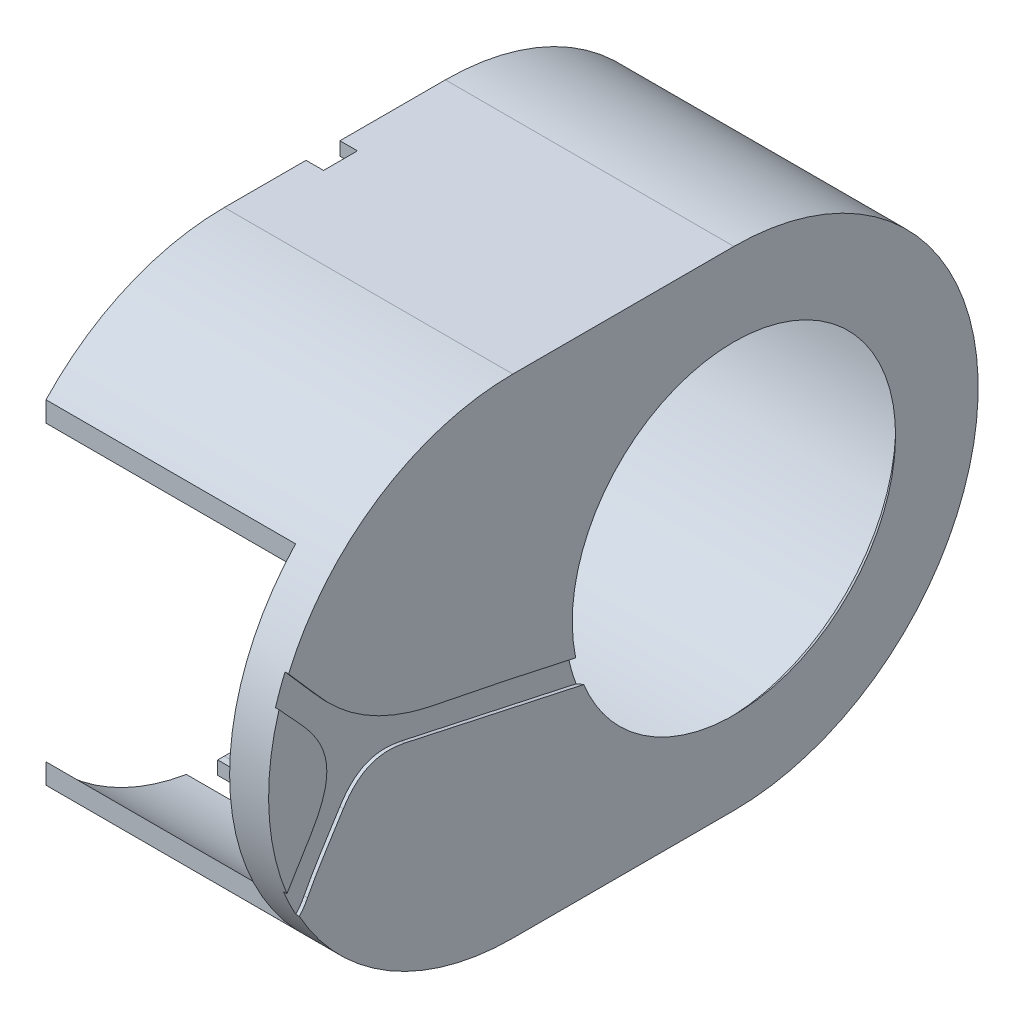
ISO-10303-21;
HEADER;
FILE_DESCRIPTION(('STEP AP214'),'2;1');
FILE_NAME('part.step','',(''),(''),'','','');
FILE_SCHEMA(('AUTOMOTIVE_DESIGN { 1 0 10303 214 1 1 1 1 }'));
ENDSEC;
DATA;
#1=APPLICATION_CONTEXT('core data for automotive mechanical design processes');
#2=APPLICATION_PROTOCOL_DEFINITION('international standard','automotive_design',2000,#1);
#3=PRODUCT_CONTEXT('',#1,'mechanical');
#4=PRODUCT('Part','Part','',(#3));
#5=PRODUCT_RELATED_PRODUCT_CATEGORY('part','',(#4));
#6=PRODUCT_DEFINITION_FORMATION('','',#4);
#7=PRODUCT_DEFINITION_CONTEXT('part definition',#1,'design');
#8=PRODUCT_DEFINITION('design','',#6,#7);
#9=PRODUCT_DEFINITION_SHAPE('','',#8);
#10=(LENGTH_UNIT() NAMED_UNIT(*) SI_UNIT(.MILLI.,.METRE.));
#11=(NAMED_UNIT(*) PLANE_ANGLE_UNIT() SI_UNIT($,.RADIAN.));
#12=(NAMED_UNIT(*) SI_UNIT($,.STERADIAN.) SOLID_ANGLE_UNIT());
#13=UNCERTAINTY_MEASURE_WITH_UNIT(LENGTH_MEASURE(1.E-05),#10,'distance_accuracy_value','');
#14=(GEOMETRIC_REPRESENTATION_CONTEXT(3) GLOBAL_UNCERTAINTY_ASSIGNED_CONTEXT((#13)) GLOBAL_UNIT_ASSIGNED_CONTEXT((#10,
#11,#12)) REPRESENTATION_CONTEXT('',''));
#15=CARTESIAN_POINT('',(0.,0.,0.));
#16=DIRECTION('',(0.,0.,1.));
#17=DIRECTION('',(1.,0.,0.));
#18=AXIS2_PLACEMENT_3D('',#15,#16,#17);
#19=CARTESIAN_POINT('',(-3.,53.4815691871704,-1.78873419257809));
#20=DIRECTION('',(0.,-1.,0.));
#21=DIRECTION('',(0.,0.,-1.));
#22=AXIS2_PLACEMENT_3D('',#19,#20,#21);
#23=PLANE('',#22);
#24=DIRECTION('',(-1.,0.,0.));
#25=VECTOR('',#24,1.);
#26=CARTESIAN_POINT('',(-66.9,53.4815691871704,21.8945026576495));
#27=LINE('',#26,#25);
#28=CARTESIAN_POINT('',(-2.8,53.4815691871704,21.8945026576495));
#29=VERTEX_POINT('',#28);
#30=CARTESIAN_POINT('',(-62.9,53.4815691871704,21.8945026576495));
#31=VERTEX_POINT('',#30);
#32=EDGE_CURVE('E564',#29,#31,#27,.T.);
#33=ORIENTED_EDGE('',*,*,#32,.T.);
#34=DIRECTION('',(0.,0.,-1.));
#35=VECTOR('',#34,1.);
#36=CARTESIAN_POINT('',(-62.9,53.4815691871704,12.1934554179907));
#37=LINE('',#36,#35);
#38=CARTESIAN_POINT('',(-62.9,53.4815691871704,22.3050171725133));
#39=VERTEX_POINT('',#38);
#40=EDGE_CURVE('E580',#39,#31,#37,.T.);
#41=ORIENTED_EDGE('',*,*,#40,.F.);
#42=DIRECTION('',(-1.,0.,0.));
#43=VECTOR('',#42,1.);
#44=CARTESIAN_POINT('',(-66.9,53.4815691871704,22.3050171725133));
#45=LINE('',#44,#43);
#46=CARTESIAN_POINT('',(-66.9,53.4815691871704,22.3050171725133));
#47=VERTEX_POINT('',#46);
#48=EDGE_CURVE('E779',#39,#47,#45,.T.);
#49=ORIENTED_EDGE('',*,*,#48,.T.);
#50=DIRECTION('',(0.,0.,1.));
#51=VECTOR('',#50,1.);
#52=CARTESIAN_POINT('',(-66.9,53.4815691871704,-1.78873419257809));
#53=LINE('',#52,#51);
#54=CARTESIAN_POINT('',(-66.9,53.4815691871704,-1.78873419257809));
#55=VERTEX_POINT('',#54);
#56=EDGE_CURVE('E709',#55,#47,#53,.T.);
#57=ORIENTED_EDGE('',*,*,#56,.F.);
#58=DIRECTION('',(1.,0.,0.));
#59=VECTOR('',#58,1.);
#60=CARTESIAN_POINT('',(-3.,53.4815691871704,-1.78873419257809));
#61=LINE('',#60,#59);
#62=CARTESIAN_POINT('',(-2.8,53.4815691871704,-1.78873419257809));
#63=VERTEX_POINT('',#62);
#64=EDGE_CURVE('E11',#55,#63,#61,.T.);
#65=ORIENTED_EDGE('',*,*,#64,.T.);
#66=DIRECTION('',(0.,0.,1.));
#67=VECTOR('',#66,1.);
#68=CARTESIAN_POINT('',(-2.8,53.4815691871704,10.8337658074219));
#69=LINE('',#68,#67);
#70=EDGE_CURVE('E818',#63,#29,#69,.T.);
#71=ORIENTED_EDGE('',*,*,#70,.T.);
#72=EDGE_LOOP('',(#33,#41,#49,#57,#65,#71));
#73=FACE_BOUND('',#72,.T.);
#74=ADVANCED_FACE('F17',(#73),#23,.T.);
#75=CARTESIAN_POINT('',(-3.,0.747569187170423,-1.78873419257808));
#76=DIRECTION('',(1.,0.,0.));
#77=DIRECTION('',(0.,-1.,0.));
#78=AXIS2_PLACEMENT_3D('',#75,#76,#77);
#79=CYLINDRICAL_SURFACE('',#78,52.734);
#80=CARTESIAN_POINT('',(-2.8,0.747569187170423,-1.78873419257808));
#81=DIRECTION('',(1.,0.,0.));
#82=DIRECTION('',(0.,-1.,0.));
#83=AXIS2_PLACEMENT_3D('',#80,#81,#82);
#84=CIRCLE('',#83,52.734);
#85=CARTESIAN_POINT('',(-2.8,-51.9864308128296,-1.78873419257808));
#86=VERTEX_POINT('',#85);
#87=EDGE_CURVE('E814',#86,#63,#84,.T.);
#88=ORIENTED_EDGE('',*,*,#87,.T.);
#89=ORIENTED_EDGE('',*,*,#64,.F.);
#90=CARTESIAN_POINT('',(-66.9,0.747569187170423,-1.78873419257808));
#91=DIRECTION('',(1.,0.,0.));
#92=DIRECTION('',(0.,-1.,0.));
#93=AXIS2_PLACEMENT_3D('',#90,#91,#92);
#94=CIRCLE('',#93,52.734);
#95=CARTESIAN_POINT('',(-66.9,-51.9864308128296,-1.78873419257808));
#96=VERTEX_POINT('',#95);
#97=EDGE_CURVE('E798',#96,#55,#94,.T.);
#98=ORIENTED_EDGE('',*,*,#97,.F.);
#99=DIRECTION('',(1.,0.,0.));
#100=VECTOR('',#99,1.);
#101=CARTESIAN_POINT('',(-3.,-51.9864308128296,-1.78873419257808));
#102=LINE('',#101,#100);
#103=EDGE_CURVE('E678',#96,#86,#102,.T.);
#104=ORIENTED_EDGE('',*,*,#103,.T.);
#105=EDGE_LOOP('',(#88,#89,#98,#104));
#106=FACE_BOUND('',#105,.T.);
#107=ADVANCED_FACE('F528',(#106),#79,.F.);
#108=CARTESIAN_POINT('',(-3.,-51.9864308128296,48.7012658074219));
#109=DIRECTION('',(0.,1.,0.));
#110=DIRECTION('',(1.,0.,0.));
#111=AXIS2_PLACEMENT_3D('',#108,#109,#110);
#112=PLANE('',#111);
#113=DIRECTION('',(-1.,0.,0.));
#114=VECTOR('',#113,1.);
#115=CARTESIAN_POINT('',(-66.9,-51.9864308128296,30.4567873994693));
#116=LINE('',#115,#114);
#117=CARTESIAN_POINT('',(-2.8,-51.9864308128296,30.4567873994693));
#118=VERTEX_POINT('',#117);
#119=CARTESIAN_POINT('',(-62.9,-51.9864308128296,30.4567873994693));
#120=VERTEX_POINT('',#119);
#121=EDGE_CURVE('E690',#118,#120,#116,.T.);
#122=ORIENTED_EDGE('',*,*,#121,.T.);
#123=DIRECTION('',(0.,0.,1.));
#124=VECTOR('',#123,1.);
#125=CARTESIAN_POINT('',(-62.9,-51.9864308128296,37.4384554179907));
#126=LINE('',#125,#124);
#127=CARTESIAN_POINT('',(-62.9,-51.9864308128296,30.0462728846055));
#128=VERTEX_POINT('',#127);
#129=EDGE_CURVE('E590',#128,#120,#126,.T.);
#130=ORIENTED_EDGE('',*,*,#129,.F.);
#131=DIRECTION('',(-1.,0.,0.));
#132=VECTOR('',#131,1.);
#133=CARTESIAN_POINT('',(-66.9,-51.9864308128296,30.0462728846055));
#134=LINE('',#133,#132);
#135=CARTESIAN_POINT('',(-66.9,-51.9864308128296,30.0462728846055));
#136=VERTEX_POINT('',#135);
#137=EDGE_CURVE('E865',#128,#136,#134,.T.);
#138=ORIENTED_EDGE('',*,*,#137,.T.);
#139=DIRECTION('',(0.,0.,-1.));
#140=VECTOR('',#139,1.);
#141=CARTESIAN_POINT('',(-66.9,-51.9864308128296,48.7012658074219));
#142=LINE('',#141,#140);
#143=CARTESIAN_POINT('',(-66.9,-51.9864308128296,48.7012658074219));
#144=VERTEX_POINT('',#143);
#145=EDGE_CURVE('E639',#144,#136,#142,.T.);
#146=ORIENTED_EDGE('',*,*,#145,.F.);
#147=DIRECTION('',(1.,0.,0.));
#148=VECTOR('',#147,1.);
#149=CARTESIAN_POINT('',(-3.,-51.9864308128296,48.7012658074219));
#150=LINE('',#149,#148);
#151=CARTESIAN_POINT('',(-2.8,-51.9864308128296,48.7012658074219));
#152=VERTEX_POINT('',#151);
#153=EDGE_CURVE('E600',#144,#152,#150,.T.);
#154=ORIENTED_EDGE('',*,*,#153,.T.);
#155=DIRECTION('',(0.,0.,-1.));
#156=VECTOR('',#155,1.);
#157=CARTESIAN_POINT('',(-2.8,-51.9864308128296,36.0787658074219));
#158=LINE('',#157,#156);
#159=EDGE_CURVE('E619',#152,#118,#158,.T.);
#160=ORIENTED_EDGE('',*,*,#159,.T.);
#161=EDGE_LOOP('',(#122,#130,#138,#146,#154,#160));
#162=FACE_BOUND('',#161,.T.);
#163=ADVANCED_FACE('F524',(#162),#112,.T.);
#164=CARTESIAN_POINT('',(-3.,0.747569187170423,-1.78873419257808));
#165=DIRECTION('',(1.,0.,0.));
#166=DIRECTION('',(0.,-1.,0.));
#167=AXIS2_PLACEMENT_3D('',#164,#165,#166);
#168=CYLINDRICAL_SURFACE('',#167,55.794);
#169=CARTESIAN_POINT('',(-1.,0.747569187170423,-1.78873419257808));
#170=DIRECTION('',(-1.,0.,0.));
#171=DIRECTION('',(0.,-1.,0.));
#172=AXIS2_PLACEMENT_3D('',#169,#170,#171);
#173=CIRCLE('',#172,55.794);
#174=CARTESIAN_POINT('',(-1.,56.5415691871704,-1.78873419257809));
#175=VERTEX_POINT('',#174);
#176=CARTESIAN_POINT('',(-1.,-55.0464308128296,-1.78873419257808));
#177=VERTEX_POINT('',#176);
#178=EDGE_CURVE('E640',#175,#177,#173,.T.);
#179=ORIENTED_EDGE('',*,*,#178,.T.);
#180=DIRECTION('',(1.,0.,0.));
#181=VECTOR('',#180,1.);
#182=CARTESIAN_POINT('',(-3.,-55.0464308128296,-1.78873419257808));
#183=LINE('',#182,#181);
#184=CARTESIAN_POINT('',(-66.9,-55.0464308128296,-1.78873419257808));
#185=VERTEX_POINT('',#184);
#186=EDGE_CURVE('E613',#185,#177,#183,.T.);
#187=ORIENTED_EDGE('',*,*,#186,.F.);
#188=CARTESIAN_POINT('',(-66.9,0.747569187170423,-1.78873419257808));
#189=DIRECTION('',(-1.,0.,0.));
#190=DIRECTION('',(0.,-1.,0.));
#191=AXIS2_PLACEMENT_3D('',#188,#189,#190);
#192=CIRCLE('',#191,55.794);
#193=CARTESIAN_POINT('',(-66.9,56.5415691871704,-1.78873419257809));
#194=VERTEX_POINT('',#193);
#195=EDGE_CURVE('E567',#194,#185,#192,.T.);
#196=ORIENTED_EDGE('',*,*,#195,.F.);
#197=DIRECTION('',(1.,0.,0.));
#198=VECTOR('',#197,1.);
#199=CARTESIAN_POINT('',(-3.,56.5415691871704,-1.78873419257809));
#200=LINE('',#199,#198);
#201=EDGE_CURVE('E773',#194,#175,#200,.T.);
#202=ORIENTED_EDGE('',*,*,#201,.T.);
#203=EDGE_LOOP('',(#179,#187,#196,#202));
#204=FACE_BOUND('',#203,.T.);
#205=ADVANCED_FACE('F521',(#204),#168,.T.);
#206=CARTESIAN_POINT('',(-2.90100505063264,0.747569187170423,-1.78873419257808));
#207=DIRECTION('',(-1.,0.,0.));
#208=DIRECTION('',(0.,0.707106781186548,-0.707106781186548));
#209=AXIS2_PLACEMENT_3D('',#206,#207,#208);
#210=CONICAL_SURFACE('',#209,38.8609748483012,0.795298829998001);
#211=CARTESIAN_POINT('',(-2.8,0.747569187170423,-1.78873419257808));
#212=DIRECTION('',(1.,0.,0.));
#213=DIRECTION('',(0.,0.707106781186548,-0.707106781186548));
#214=AXIS2_PLACEMENT_3D('',#211,#212,#213);
#215=CIRCLE('',#214,38.7579496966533);
#216=CARTESIAN_POINT('',(-2.8,-26.6584398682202,25.6172748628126));
#217=VERTEX_POINT('',#216);
#218=EDGE_CURVE('E614',#217,#217,#215,.T.);
#219=ORIENTED_EDGE('',*,*,#218,.F.);
#220=DIRECTION('',(0.700071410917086,0.504925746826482,-0.504925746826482));
#221=VECTOR('',#220,1.);
#222=CARTESIAN_POINT('',(-2.90100505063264,-26.7312896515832,25.6901246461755));
#223=LINE('',#222,#221);
#224=CARTESIAN_POINT('',(-1.,-25.3601918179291,24.3190268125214));
#225=VERTEX_POINT('',#224);
#226=EDGE_CURVE('E28',#217,#225,#223,.T.);
#227=ORIENTED_EDGE('',*,*,#226,.T.);
#228=CARTESIAN_POINT('',(-1.,0.747569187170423,-1.78873419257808));
#229=DIRECTION('',(1.,0.,0.));
#230=DIRECTION('',(0.,0.707106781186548,-0.707106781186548));
#231=AXIS2_PLACEMENT_3D('',#228,#229,#230);
#232=CIRCLE('',#231,36.9219496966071);
#233=CARTESIAN_POINT('',(-1.,-6.76661414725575,34.3605039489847));
#234=VERTEX_POINT('',#233);
#235=EDGE_CURVE('E1068',#225,#234,#232,.T.);
#236=ORIENTED_EDGE('',*,*,#235,.T.);
#237=CARTESIAN_POINT('',(-1.,-6.76661414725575,34.3605039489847));
#238=CARTESIAN_POINT('',(-1.13314610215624,-6.73443109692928,34.5059057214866));
#239=CARTESIAN_POINT('',(-1.26638879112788,-6.70226966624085,34.6512487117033));
#240=CARTESIAN_POINT('',(-1.39969796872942,-6.67013638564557,34.7965058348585));
#241=CARTESIAN_POINT('',(-1.53304833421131,-6.63799317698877,34.9418078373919));
#242=CARTESIAN_POINT('',(-1.66649212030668,-6.60587165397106,35.0870532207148));
#243=CARTESIAN_POINT('',(-1.8,-6.57377819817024,35.2322155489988));
#244=(BOUNDED_CURVE() B_SPLINE_CURVE(3,(#237,#238,#239,#240,#241,#242,#243),.UNSPECIFIED.,.F.,
.F.) B_SPLINE_CURVE_WITH_KNOTS((4,3,4),(0.,0.0592787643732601,0.118575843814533),
.UNSPECIFIED.) CURVE() GEOMETRIC_REPRESENTATION_ITEM() RATIONAL_B_SPLINE_CURVE((1.,1.,1.,1.,1.,
1.,1.)) REPRESENTATION_ITEM(''));
#245=CARTESIAN_POINT('',(-1.8,-6.57377819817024,35.2322155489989));
#246=VERTEX_POINT('',#245);
#247=EDGE_CURVE('E696',#234,#246,#244,.T.);
#248=ORIENTED_EDGE('',*,*,#247,.T.);
#249=CARTESIAN_POINT('',(-1.8,0.747569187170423,-1.78873419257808));
#250=DIRECTION('',(1.,0.,0.));
#251=DIRECTION('',(0.,0.707106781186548,-0.707106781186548));
#252=AXIS2_PLACEMENT_3D('',#249,#250,#251);
#253=CIRCLE('',#252,37.7379496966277);
#254=CARTESIAN_POINT('',(-1.8,-12.75963466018,33.449147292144));
#255=VERTEX_POINT('',#254);
#256=EDGE_CURVE('E716',#246,#255,#253,.T.);
#257=ORIENTED_EDGE('',*,*,#256,.T.);
#258=CARTESIAN_POINT('',(-1.8,-12.75963466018,33.449147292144));
#259=CARTESIAN_POINT('',(-1.66655929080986,-12.7942660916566,33.2901062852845));
#260=CARTESIAN_POINT('',(-1.53328526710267,-12.828935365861,33.13089369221));
#261=CARTESIAN_POINT('',(-1.26662281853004,-12.8984726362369,32.8115598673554));
#262=CARTESIAN_POINT('',(-1.1332031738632,-12.9333494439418,32.6513981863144));
#263=CARTESIAN_POINT('',(-1.,-12.9682582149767,32.4910914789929));
#264=(BOUNDED_CURVE() B_SPLINE_CURVE(3,(#258,#259,#260,#261,#262,#263),.UNSPECIFIED.,.F.,
.F.) B_SPLINE_CURVE_WITH_KNOTS((4,2,4),(0.,0.0624050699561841,0.125057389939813),
.UNSPECIFIED.) CURVE() GEOMETRIC_REPRESENTATION_ITEM() RATIONAL_B_SPLINE_CURVE((1.,1.,1.,1.,1.,1.)) REPRESENTATION_ITEM(''));
#265=CARTESIAN_POINT('',(-1.,-12.9682582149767,32.4910914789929));
#266=VERTEX_POINT('',#265);
#267=EDGE_CURVE('E392',#255,#266,#264,.T.);
#268=ORIENTED_EDGE('',*,*,#267,.T.);
#269=CARTESIAN_POINT('',(-1.,0.747569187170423,-1.78873419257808));
#270=DIRECTION('',(1.,0.,0.));
#271=DIRECTION('',(0.,0.707106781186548,-0.707106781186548));
#272=AXIS2_PLACEMENT_3D('',#269,#270,#271);
#273=CIRCLE('',#272,36.9219496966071);
#274=EDGE_CURVE('E978',#266,#225,#273,.T.);
#275=ORIENTED_EDGE('',*,*,#274,.T.);
#276=ORIENTED_EDGE('',*,*,#226,.F.);
#277=EDGE_LOOP('',(#219,#227,#236,#248,#257,#268,#275,#276));
#278=FACE_BOUND('',#277,.T.);
#279=ADVANCED_FACE('F494',(#278),#210,.F.);
#280=CARTESIAN_POINT('',(-3.,-51.9864308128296,48.7012658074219));
#281=DIRECTION('',(0.,1.,0.));
#282=DIRECTION('',(1.,0.,0.));
#283=AXIS2_PLACEMENT_3D('',#280,#281,#282);
#284=PLANE('',#283);
#285=DIRECTION('',(1.,0.,0.));
#286=VECTOR('',#285,1.);
#287=CARTESIAN_POINT('',(-66.9,-51.9864308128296,22.3050171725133));
#288=LINE('',#287,#286);
#289=CARTESIAN_POINT('',(-66.9,-51.9864308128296,22.3050171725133));
#290=VERTEX_POINT('',#289);
#291=CARTESIAN_POINT('',(-62.9,-51.9864308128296,22.3050171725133));
#292=VERTEX_POINT('',#291);
#293=EDGE_CURVE('E811',#290,#292,#288,.T.);
#294=ORIENTED_EDGE('',*,*,#293,.T.);
#295=DIRECTION('',(0.,0.,1.));
#296=VECTOR('',#295,1.);
#297=CARTESIAN_POINT('',(-62.9,-51.9864308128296,37.4384554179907));
#298=LINE('',#297,#296);
#299=CARTESIAN_POINT('',(-62.9,-51.9864308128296,21.8945026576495));
#300=VERTEX_POINT('',#299);
#301=EDGE_CURVE('E857',#300,#292,#298,.T.);
#302=ORIENTED_EDGE('',*,*,#301,.F.);
#303=DIRECTION('',(1.,0.,0.));
#304=VECTOR('',#303,1.);
#305=CARTESIAN_POINT('',(-66.9,-51.9864308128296,21.8945026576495));
#306=LINE('',#305,#304);
#307=CARTESIAN_POINT('',(-2.8,-51.9864308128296,21.8945026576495));
#308=VERTEX_POINT('',#307);
#309=EDGE_CURVE('E687',#300,#308,#306,.T.);
#310=ORIENTED_EDGE('',*,*,#309,.T.);
#311=DIRECTION('',(0.,0.,-1.));
#312=VECTOR('',#311,1.);
#313=CARTESIAN_POINT('',(-2.8,-51.9864308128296,36.0787658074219));
#314=LINE('',#313,#312);
#315=EDGE_CURVE('E673',#308,#86,#314,.T.);
#316=ORIENTED_EDGE('',*,*,#315,.T.);
#317=ORIENTED_EDGE('',*,*,#103,.F.);
#318=DIRECTION('',(0.,0.,-1.));
#319=VECTOR('',#318,1.);
#320=CARTESIAN_POINT('',(-66.9,-51.9864308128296,48.7012658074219));
#321=LINE('',#320,#319);
#322=EDGE_CURVE('E772',#290,#96,#321,.T.);
#323=ORIENTED_EDGE('',*,*,#322,.F.);
#324=EDGE_LOOP('',(#294,#302,#310,#316,#317,#323));
#325=FACE_BOUND('',#324,.T.);
#326=ADVANCED_FACE('F1223',(#325),#284,.T.);
#327=CARTESIAN_POINT('',(-66.9,-51.7824308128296,26.1756450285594));
#328=DIRECTION('',(1.,0.,0.));
#329=DIRECTION('',(0.,1.,0.));
#330=AXIS2_PLACEMENT_3D('',#327,#328,#329);
#331=CYLINDRICAL_SURFACE('',#330,4.286);
#332=CARTESIAN_POINT('',(-2.8,-51.7824308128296,26.1756450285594));
#333=DIRECTION('',(1.,0.,0.));
#334=DIRECTION('',(0.,-1.,0.));
#335=AXIS2_PLACEMENT_3D('',#332,#333,#334);
#336=CIRCLE('',#335,4.286);
#337=EDGE_CURVE('E666',#308,#118,#336,.T.);
#338=ORIENTED_EDGE('',*,*,#337,.F.);
#339=ORIENTED_EDGE('',*,*,#309,.F.);
#340=CARTESIAN_POINT('',(-62.9,-51.7824308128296,26.1756450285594));
#341=DIRECTION('',(1.,0.,0.));
#342=DIRECTION('',(0.,-1.,0.));
#343=AXIS2_PLACEMENT_3D('',#340,#341,#342);
#344=CIRCLE('',#343,4.286);
#345=EDGE_CURVE('E594',#300,#120,#344,.T.);
#346=ORIENTED_EDGE('',*,*,#345,.T.);
#347=ORIENTED_EDGE('',*,*,#121,.F.);
#348=EDGE_LOOP('',(#338,#339,#346,#347));
#349=FACE_BOUND('',#348,.T.);
#350=ADVANCED_FACE('F1220',(#349),#331,.T.);
#351=CARTESIAN_POINT('',(-56.9,-50.9664308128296,26.1756450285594));
#352=DIRECTION('',(-1.,0.,0.));
#353=DIRECTION('',(0.,0.,1.));
#354=AXIS2_PLACEMENT_3D('',#351,#352,#353);
#355=PLANE('',#354);
#356=CARTESIAN_POINT('',(-56.9,-50.9664308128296,26.1756450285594));
#357=DIRECTION('',(1.,0.,0.));
#358=DIRECTION('',(0.,-1.,0.));
#359=AXIS2_PLACEMENT_3D('',#356,#357,#358);
#360=CIRCLE('',#359,2.);
#361=CARTESIAN_POINT('',(-56.9,-48.9664308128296,26.1756450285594));
#362=VERTEX_POINT('',#361);
#363=EDGE_CURVE('E42',#362,#362,#360,.T.);
#364=ORIENTED_EDGE('',*,*,#363,.F.);
#365=EDGE_LOOP('',(#364));
#366=FACE_BOUND('',#365,.T.);
#367=ADVANCED_FACE('F1344',(#366),#355,.T.);
#368=CARTESIAN_POINT('',(-66.9,-50.9664308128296,26.1756450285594));
#369=DIRECTION('',(1.,0.,0.));
#370=DIRECTION('',(0.,-1.,0.));
#371=AXIS2_PLACEMENT_3D('',#368,#369,#370);
#372=CYLINDRICAL_SURFACE('',#371,2.);
#373=CARTESIAN_POINT('',(-62.9,-50.9664308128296,26.1756450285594));
#374=DIRECTION('',(-1.,0.,0.));
#375=DIRECTION('',(0.,-1.,0.));
#376=AXIS2_PLACEMENT_3D('',#373,#374,#375);
#377=CIRCLE('',#376,2.);
#378=CARTESIAN_POINT('',(-62.9,-48.9664308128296,26.1756450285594));
#379=VERTEX_POINT('',#378);
#380=EDGE_CURVE('E624',#379,#379,#377,.T.);
#381=ORIENTED_EDGE('',*,*,#380,.T.);
#382=DIRECTION('',(1.,0.,0.));
#383=VECTOR('',#382,1.);
#384=CARTESIAN_POINT('',(-66.9,-48.9664308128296,26.1756450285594));
#385=LINE('',#384,#383);
#386=EDGE_CURVE('E706',#379,#362,#385,.T.);
#387=ORIENTED_EDGE('',*,*,#386,.T.);
#388=ORIENTED_EDGE('',*,*,#363,.T.);
#389=ORIENTED_EDGE('',*,*,#386,.F.);
#390=EDGE_LOOP('',(#381,#387,#388,#389));
#391=FACE_BOUND('',#390,.T.);
#392=ADVANCED_FACE('F1202',(#391),#372,.F.);
#393=CARTESIAN_POINT('',(-3.,53.4815691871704,-1.78873419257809));
#394=DIRECTION('',(0.,-1.,0.));
#395=DIRECTION('',(0.,0.,-1.));
#396=AXIS2_PLACEMENT_3D('',#393,#394,#395);
#397=PLANE('',#396);
#398=DIRECTION('',(1.,0.,0.));
#399=VECTOR('',#398,1.);
#400=CARTESIAN_POINT('',(-66.9,53.4815691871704,30.0462728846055));
#401=LINE('',#400,#399);
#402=CARTESIAN_POINT('',(-66.9,53.4815691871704,30.0462728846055));
#403=VERTEX_POINT('',#402);
#404=CARTESIAN_POINT('',(-62.9,53.4815691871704,30.0462728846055));
#405=VERTEX_POINT('',#404);
#406=EDGE_CURVE('E752',#403,#405,#401,.T.);
#407=ORIENTED_EDGE('',*,*,#406,.T.);
#408=DIRECTION('',(0.,0.,-1.));
#409=VECTOR('',#408,1.);
#410=CARTESIAN_POINT('',(-62.9,53.4815691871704,12.1934554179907));
#411=LINE('',#410,#409);
#412=CARTESIAN_POINT('',(-62.9,53.4815691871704,30.4567873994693));
#413=VERTEX_POINT('',#412);
#414=EDGE_CURVE('E579',#413,#405,#411,.T.);
#415=ORIENTED_EDGE('',*,*,#414,.F.);
#416=DIRECTION('',(1.,0.,0.));
#417=VECTOR('',#416,1.);
#418=CARTESIAN_POINT('',(-66.9,53.4815691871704,30.4567873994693));
#419=LINE('',#418,#417);
#420=CARTESIAN_POINT('',(-2.8,53.4815691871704,30.4567873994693));
#421=VERTEX_POINT('',#420);
#422=EDGE_CURVE('E568',#413,#421,#419,.T.);
#423=ORIENTED_EDGE('',*,*,#422,.T.);
#424=DIRECTION('',(0.,0.,1.));
#425=VECTOR('',#424,1.);
#426=CARTESIAN_POINT('',(-2.8,53.4815691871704,10.8337658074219));
#427=LINE('',#426,#425);
#428=CARTESIAN_POINT('',(-2.8,53.4815691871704,48.7012658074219));
#429=VERTEX_POINT('',#428);
#430=EDGE_CURVE('E878',#421,#429,#427,.T.);
#431=ORIENTED_EDGE('',*,*,#430,.T.);
#432=DIRECTION('',(-1.,0.,0.));
#433=VECTOR('',#432,1.);
#434=CARTESIAN_POINT('',(-3.,53.4815691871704,48.7012658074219));
#435=LINE('',#434,#433);
#436=CARTESIAN_POINT('',(-66.9,53.4815691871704,48.7012658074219));
#437=VERTEX_POINT('',#436);
#438=EDGE_CURVE('E724',#429,#437,#435,.T.);
#439=ORIENTED_EDGE('',*,*,#438,.T.);
#440=DIRECTION('',(0.,0.,1.));
#441=VECTOR('',#440,1.);
#442=CARTESIAN_POINT('',(-66.9,53.4815691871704,-1.78873419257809));
#443=LINE('',#442,#441);
#444=EDGE_CURVE('E879',#403,#437,#443,.T.);
#445=ORIENTED_EDGE('',*,*,#444,.F.);
#446=EDGE_LOOP('',(#407,#415,#423,#431,#439,#445));
#447=FACE_BOUND('',#446,.T.);
#448=ADVANCED_FACE('F1166',(#447),#397,.T.);
#449=CARTESIAN_POINT('',(-66.9,0.747569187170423,23.4562658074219));
#450=DIRECTION('',(1.,0.,0.));
#451=DIRECTION('',(0.,1.,0.));
#452=AXIS2_PLACEMENT_3D('',#449,#450,#451);
#453=PLANE('',#452);
#454=DIRECTION('',(0.,1.,0.));
#455=VECTOR('',#454,1.);
#456=CARTESIAN_POINT('',(-66.9,28.6445691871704,22.3050171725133));
#457=LINE('',#456,#455);
#458=CARTESIAN_POINT('',(-66.9,56.5415691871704,22.3050171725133));
#459=VERTEX_POINT('',#458);
#460=EDGE_CURVE('E784',#47,#459,#457,.T.);
#461=ORIENTED_EDGE('',*,*,#460,.T.);
#462=DIRECTION('',(0.,0.,-1.));
#463=VECTOR('',#462,1.);
#464=CARTESIAN_POINT('',(-66.9,56.5415691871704,36.0787658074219));
#465=LINE('',#464,#463);
#466=EDGE_CURVE('E657',#459,#194,#465,.T.);
#467=ORIENTED_EDGE('',*,*,#466,.T.);
#468=ORIENTED_EDGE('',*,*,#195,.T.);
#469=DIRECTION('',(0.,0.,1.));
#470=VECTOR('',#469,1.);
#471=CARTESIAN_POINT('',(-66.9,-55.0464308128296,10.8337658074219));
#472=LINE('',#471,#470);
#473=CARTESIAN_POINT('',(-66.9,-55.0464308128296,22.3050171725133));
#474=VERTEX_POINT('',#473);
#475=EDGE_CURVE('E620',#185,#474,#472,.T.);
#476=ORIENTED_EDGE('',*,*,#475,.T.);
#477=DIRECTION('',(0.,1.,0.));
#478=VECTOR('',#477,1.);
#479=CARTESIAN_POINT('',(-66.9,-27.1494308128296,22.3050171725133));
#480=LINE('',#479,#478);
#481=EDGE_CURVE('E652',#474,#290,#480,.T.);
#482=ORIENTED_EDGE('',*,*,#481,.T.);
#483=ORIENTED_EDGE('',*,*,#322,.T.);
#484=ORIENTED_EDGE('',*,*,#97,.T.);
#485=ORIENTED_EDGE('',*,*,#56,.T.);
#486=EDGE_LOOP('',(#461,#467,#468,#476,#482,#483,#484,#485));
#487=FACE_BOUND('',#486,.T.);
#488=ADVANCED_FACE('F1343',(#487),#453,.F.);
#489=CARTESIAN_POINT('',(-66.9,53.2775691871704,26.1756450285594));
#490=DIRECTION('',(1.,0.,0.));
#491=DIRECTION('',(0.,-1.,0.));
#492=AXIS2_PLACEMENT_3D('',#489,#490,#491);
#493=CYLINDRICAL_SURFACE('',#492,4.286);
#494=CARTESIAN_POINT('',(-2.8,53.2775691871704,26.1756450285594));
#495=DIRECTION('',(1.,0.,0.));
#496=DIRECTION('',(0.,1.,0.));
#497=AXIS2_PLACEMENT_3D('',#494,#495,#496);
#498=CIRCLE('',#497,4.286);
#499=EDGE_CURVE('E874',#421,#29,#498,.T.);
#500=ORIENTED_EDGE('',*,*,#499,.F.);
#501=ORIENTED_EDGE('',*,*,#422,.F.);
#502=CARTESIAN_POINT('',(-62.9,53.2775691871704,26.1756450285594));
#503=DIRECTION('',(1.,0.,0.));
#504=DIRECTION('',(0.,1.,0.));
#505=AXIS2_PLACEMENT_3D('',#502,#503,#504);
#506=CIRCLE('',#505,4.286);
#507=EDGE_CURVE('E575',#413,#31,#506,.T.);
#508=ORIENTED_EDGE('',*,*,#507,.T.);
#509=ORIENTED_EDGE('',*,*,#32,.F.);
#510=EDGE_LOOP('',(#500,#501,#508,#509));
#511=FACE_BOUND('',#510,.T.);
#512=ADVANCED_FACE('F1185',(#511),#493,.T.);
#513=CARTESIAN_POINT('',(-56.9,52.4615691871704,26.1756450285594));
#514=DIRECTION('',(-1.,0.,0.));
#515=DIRECTION('',(0.,0.,1.));
#516=AXIS2_PLACEMENT_3D('',#513,#514,#515);
#517=PLANE('',#516);
#518=CARTESIAN_POINT('',(-56.9,52.4615691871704,26.1756450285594));
#519=DIRECTION('',(-1.,0.,0.));
#520=DIRECTION('',(0.,1.,0.));
#521=AXIS2_PLACEMENT_3D('',#518,#519,#520);
#522=CIRCLE('',#521,2.);
#523=CARTESIAN_POINT('',(-56.9,50.4615691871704,26.1756450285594));
#524=VERTEX_POINT('',#523);
#525=EDGE_CURVE('E612',#524,#524,#522,.T.);
#526=ORIENTED_EDGE('',*,*,#525,.T.);
#527=EDGE_LOOP('',(#526));
#528=FACE_BOUND('',#527,.T.);
#529=ADVANCED_FACE('F1329',(#528),#517,.T.);
#530=CARTESIAN_POINT('',(-66.9,52.4615691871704,26.1756450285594));
#531=DIRECTION('',(1.,0.,0.));
#532=DIRECTION('',(0.,1.,0.));
#533=AXIS2_PLACEMENT_3D('',#530,#531,#532);
#534=CYLINDRICAL_SURFACE('',#533,2.);
#535=CARTESIAN_POINT('',(-62.9,52.4615691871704,26.1756450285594));
#536=DIRECTION('',(-1.,0.,0.));
#537=DIRECTION('',(0.,1.,0.));
#538=AXIS2_PLACEMENT_3D('',#535,#536,#537);
#539=CIRCLE('',#538,2.);
#540=CARTESIAN_POINT('',(-62.9,50.4615691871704,26.1756450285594));
#541=VERTEX_POINT('',#540);
#542=EDGE_CURVE('E589',#541,#541,#539,.T.);
#543=ORIENTED_EDGE('',*,*,#542,.T.);
#544=DIRECTION('',(1.,0.,0.));
#545=VECTOR('',#544,1.);
#546=CARTESIAN_POINT('',(-66.9,50.4615691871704,26.1756450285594));
#547=LINE('',#546,#545);
#548=EDGE_CURVE('E608',#541,#524,#547,.T.);
#549=ORIENTED_EDGE('',*,*,#548,.T.);
#550=ORIENTED_EDGE('',*,*,#525,.F.);
#551=ORIENTED_EDGE('',*,*,#548,.F.);
#552=EDGE_LOOP('',(#543,#549,#550,#551));
#553=FACE_BOUND('',#552,.T.);
#554=ADVANCED_FACE('F1331',(#553),#534,.F.);
#555=CARTESIAN_POINT('',(-59.9,-35.8695674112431,89.436709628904));
#556=DIRECTION('',(0.,0.,-1.));
#557=DIRECTION('',(0.,-1.,0.));
#558=AXIS2_PLACEMENT_3D('',#555,#556,#557);
#559=PLANE('',#558);
#560=DIRECTION('',(1.,0.,0.));
#561=VECTOR('',#560,1.);
#562=CARTESIAN_POINT('',(-3.,-32.7412106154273,89.436709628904));
#563=LINE('',#562,#561);
#564=CARTESIAN_POINT('',(-66.9,-32.7412106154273,89.436709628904));
#565=VERTEX_POINT('',#564);
#566=CARTESIAN_POINT('',(-9.9,-32.7412106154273,89.436709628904));
#567=VERTEX_POINT('',#566);
#568=EDGE_CURVE('E569',#565,#567,#563,.T.);
#569=ORIENTED_EDGE('',*,*,#568,.F.);
#570=DIRECTION('',(0.,1.,0.));
#571=VECTOR('',#570,1.);
#572=CARTESIAN_POINT('',(-66.9,-15.9968207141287,89.4367096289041));
#573=LINE('',#572,#571);
#574=CARTESIAN_POINT('',(-66.9,-37.378459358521,89.4367096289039));
#575=VERTEX_POINT('',#574);
#576=EDGE_CURVE('E649',#575,#565,#573,.T.);
#577=ORIENTED_EDGE('',*,*,#576,.F.);
#578=DIRECTION('',(-1.,0.,0.));
#579=VECTOR('',#578,1.);
#580=CARTESIAN_POINT('',(-3.,-37.378459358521,89.436709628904));
#581=LINE('',#580,#579);
#582=CARTESIAN_POINT('',(-9.9,-37.378459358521,89.436709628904));
#583=VERTEX_POINT('',#582);
#584=EDGE_CURVE('E584',#583,#575,#581,.T.);
#585=ORIENTED_EDGE('',*,*,#584,.F.);
#586=DIRECTION('',(0.,1.,0.));
#587=VECTOR('',#586,1.);
#588=CARTESIAN_POINT('',(-9.9,34.2363489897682,89.436709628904));
#589=LINE('',#588,#587);
#590=EDGE_CURVE('E791',#583,#567,#589,.T.);
#591=ORIENTED_EDGE('',*,*,#590,.T.);
#592=EDGE_LOOP('',(#569,#577,#585,#591));
#593=FACE_BOUND('',#592,.T.);
#594=ADVANCED_FACE('F444',(#593),#559,.F.);
#595=CARTESIAN_POINT('',(-59.9,-35.8695674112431,89.436709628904));
#596=DIRECTION('',(0.,0.,-1.));
#597=DIRECTION('',(0.,-1.,0.));
#598=AXIS2_PLACEMENT_3D('',#595,#596,#597);
#599=PLANE('',#598);
#600=DIRECTION('',(0.,1.,0.));
#601=VECTOR('',#600,1.);
#602=CARTESIAN_POINT('',(-9.9,34.2363489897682,89.436709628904));
#603=LINE('',#602,#601);
#604=CARTESIAN_POINT('',(-9.9,34.2363489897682,89.436709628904));
#605=VERTEX_POINT('',#604);
#606=CARTESIAN_POINT('',(-9.9,38.8735977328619,89.436709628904));
#607=VERTEX_POINT('',#606);
#608=EDGE_CURVE('E806',#605,#607,#603,.T.);
#609=ORIENTED_EDGE('',*,*,#608,.T.);
#610=DIRECTION('',(1.,0.,0.));
#611=VECTOR('',#610,1.);
#612=CARTESIAN_POINT('',(-3.,38.8735977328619,89.436709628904));
#613=LINE('',#612,#611);
#614=CARTESIAN_POINT('',(-66.9,38.8735977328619,89.436709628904));
#615=VERTEX_POINT('',#614);
#616=EDGE_CURVE('E585',#615,#607,#613,.T.);
#617=ORIENTED_EDGE('',*,*,#616,.F.);
#618=DIRECTION('',(0.,1.,0.));
#619=VECTOR('',#618,1.);
#620=CARTESIAN_POINT('',(-66.9,19.8105834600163,89.436709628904));
#621=LINE('',#620,#619);
#622=CARTESIAN_POINT('',(-66.9,34.2363489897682,89.436709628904));
#623=VERTEX_POINT('',#622);
#624=EDGE_CURVE('E618',#623,#615,#621,.T.);
#625=ORIENTED_EDGE('',*,*,#624,.F.);
#626=DIRECTION('',(-1.,0.,0.));
#627=VECTOR('',#626,1.);
#628=CARTESIAN_POINT('',(-3.,34.2363489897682,89.436709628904));
#629=LINE('',#628,#627);
#630=EDGE_CURVE('E602',#605,#623,#629,.T.);
#631=ORIENTED_EDGE('',*,*,#630,.F.);
#632=EDGE_LOOP('',(#609,#617,#625,#631));
#633=FACE_BOUND('',#632,.T.);
#634=ADVANCED_FACE('F513',(#633),#599,.F.);
#635=CARTESIAN_POINT('',(-3.,-55.0464308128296,-1.78873419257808));
#636=DIRECTION('',(0.,-1.,0.));
#637=DIRECTION('',(-1.,0.,0.));
#638=AXIS2_PLACEMENT_3D('',#635,#636,#637);
#639=PLANE('',#638);
#640=DIRECTION('',(1.,0.,0.));
#641=VECTOR('',#640,1.);
#642=CARTESIAN_POINT('',(-34.95,-55.0464308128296,30.0462728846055));
#643=LINE('',#642,#641);
#644=CARTESIAN_POINT('',(-66.9,-55.0464308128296,30.0462728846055));
#645=VERTEX_POINT('',#644);
#646=CARTESIAN_POINT('',(-62.9,-55.0464308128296,30.0462728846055));
#647=VERTEX_POINT('',#646);
#648=EDGE_CURVE('E950',#645,#647,#643,.T.);
#649=ORIENTED_EDGE('',*,*,#648,.T.);
#650=DIRECTION('',(0.,0.,-1.));
#651=VECTOR('',#650,1.);
#652=CARTESIAN_POINT('',(-62.9,-55.0464308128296,12.1934554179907));
#653=LINE('',#652,#651);
#654=CARTESIAN_POINT('',(-62.9,-55.0464308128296,22.3050171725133));
#655=VERTEX_POINT('',#654);
#656=EDGE_CURVE('E595',#647,#655,#653,.T.);
#657=ORIENTED_EDGE('',*,*,#656,.T.);
#658=DIRECTION('',(-1.,0.,0.));
#659=VECTOR('',#658,1.);
#660=CARTESIAN_POINT('',(-34.95,-55.0464308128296,22.3050171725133));
#661=LINE('',#660,#659);
#662=EDGE_CURVE('E656',#655,#474,#661,.T.);
#663=ORIENTED_EDGE('',*,*,#662,.T.);
#664=ORIENTED_EDGE('',*,*,#475,.F.);
#665=ORIENTED_EDGE('',*,*,#186,.T.);
#666=DIRECTION('',(0.,0.,1.));
#667=VECTOR('',#666,1.);
#668=CARTESIAN_POINT('',(-1.,-55.0464308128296,10.8337658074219));
#669=LINE('',#668,#667);
#670=CARTESIAN_POINT('',(-1.,-55.0464308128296,48.7012658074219));
#671=VERTEX_POINT('',#670);
#672=EDGE_CURVE('E645',#177,#671,#669,.T.);
#673=ORIENTED_EDGE('',*,*,#672,.T.);
#674=DIRECTION('',(1.,0.,0.));
#675=VECTOR('',#674,1.);
#676=CARTESIAN_POINT('',(-3.,-55.0464308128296,48.7012658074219));
#677=LINE('',#676,#675);
#678=CARTESIAN_POINT('',(-66.9,-55.0464308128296,48.7012658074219));
#679=VERTEX_POINT('',#678);
#680=EDGE_CURVE('E972',#679,#671,#677,.T.);
#681=ORIENTED_EDGE('',*,*,#680,.F.);
#682=DIRECTION('',(0.,0.,1.));
#683=VECTOR('',#682,1.);
#684=CARTESIAN_POINT('',(-66.9,-55.0464308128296,10.8337658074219));
#685=LINE('',#684,#683);
#686=EDGE_CURVE('E389',#645,#679,#685,.T.);
#687=ORIENTED_EDGE('',*,*,#686,.F.);
#688=EDGE_LOOP('',(#649,#657,#663,#664,#665,#673,#681,#687));
#689=FACE_BOUND('',#688,.T.);
#690=ADVANCED_FACE('F504',(#689),#639,.T.);
#691=CARTESIAN_POINT('',(-62.9,-51.4764308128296,26.1756450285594));
#692=DIRECTION('',(-1.,0.,0.));
#693=DIRECTION('',(0.,0.,1.));
#694=AXIS2_PLACEMENT_3D('',#691,#692,#693);
#695=PLANE('',#694);
#696=ORIENTED_EDGE('',*,*,#380,.F.);
#697=EDGE_LOOP('',(#696));
#698=FACE_BOUND('',#697,.T.);
#699=ORIENTED_EDGE('',*,*,#656,.F.);
#700=DIRECTION('',(0.,-1.,0.));
#701=VECTOR('',#700,1.);
#702=CARTESIAN_POINT('',(-62.9,-51.9864308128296,30.0462728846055));
#703=LINE('',#702,#701);
#704=EDGE_CURVE('E868',#128,#647,#703,.T.);
#705=ORIENTED_EDGE('',*,*,#704,.F.);
#706=ORIENTED_EDGE('',*,*,#129,.T.);
#707=ORIENTED_EDGE('',*,*,#345,.F.);
#708=ORIENTED_EDGE('',*,*,#301,.T.);
#709=DIRECTION('',(0.,1.,0.));
#710=VECTOR('',#709,1.);
#711=CARTESIAN_POINT('',(-62.9,-51.9864308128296,22.3050171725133));
#712=LINE('',#711,#710);
#713=EDGE_CURVE('E807',#655,#292,#712,.T.);
#714=ORIENTED_EDGE('',*,*,#713,.F.);
#715=EDGE_LOOP('',(#699,#705,#706,#707,#708,#714));
#716=FACE_BOUND('',#715,.T.);
#717=ADVANCED_FACE('F512',(#698,#716),#695,.T.);
#718=CARTESIAN_POINT('',(-66.9,-51.9864308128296,30.0462728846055));
#719=DIRECTION('',(0.,0.,1.));
#720=DIRECTION('',(1.,0.,0.));
#721=AXIS2_PLACEMENT_3D('',#718,#719,#720);
#722=PLANE('',#721);
#723=DIRECTION('',(0.,-1.,0.));
#724=VECTOR('',#723,1.);
#725=CARTESIAN_POINT('',(-66.9,-25.6194308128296,30.0462728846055));
#726=LINE('',#725,#724);
#727=EDGE_CURVE('E633',#136,#645,#726,.T.);
#728=ORIENTED_EDGE('',*,*,#727,.F.);
#729=ORIENTED_EDGE('',*,*,#137,.F.);
#730=ORIENTED_EDGE('',*,*,#704,.T.);
#731=ORIENTED_EDGE('',*,*,#648,.F.);
#732=EDGE_LOOP('',(#728,#729,#730,#731));
#733=FACE_BOUND('',#732,.T.);
#734=ADVANCED_FACE('F1207',(#733),#722,.F.);
#735=CARTESIAN_POINT('',(-66.9,-55.0464308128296,22.3050171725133));
#736=DIRECTION('',(0.,0.,-1.));
#737=DIRECTION('',(0.,-1.,0.));
#738=AXIS2_PLACEMENT_3D('',#735,#736,#737);
#739=PLANE('',#738);
#740=ORIENTED_EDGE('',*,*,#481,.F.);
#741=ORIENTED_EDGE('',*,*,#662,.F.);
#742=ORIENTED_EDGE('',*,*,#713,.T.);
#743=ORIENTED_EDGE('',*,*,#293,.F.);
#744=EDGE_LOOP('',(#740,#741,#742,#743));
#745=FACE_BOUND('',#744,.T.);
#746=ADVANCED_FACE('F1227',(#745),#739,.F.);
#747=CARTESIAN_POINT('',(-3.,56.5415691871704,48.7012658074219));
#748=DIRECTION('',(0.,1.,0.));
#749=DIRECTION('',(1.,0.,0.));
#750=AXIS2_PLACEMENT_3D('',#747,#748,#749);
#751=PLANE('',#750);
#752=DIRECTION('',(1.,0.,0.));
#753=VECTOR('',#752,1.);
#754=CARTESIAN_POINT('',(-34.95,56.5415691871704,22.3050171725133));
#755=LINE('',#754,#753);
#756=CARTESIAN_POINT('',(-62.9,56.5415691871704,22.3050171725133));
#757=VERTEX_POINT('',#756);
#758=EDGE_CURVE('E873',#459,#757,#755,.T.);
#759=ORIENTED_EDGE('',*,*,#758,.T.);
#760=DIRECTION('',(0.,0.,1.));
#761=VECTOR('',#760,1.);
#762=CARTESIAN_POINT('',(-62.9,56.5415691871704,37.4384554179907));
#763=LINE('',#762,#761);
#764=CARTESIAN_POINT('',(-62.9,56.5415691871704,30.0462728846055));
#765=VERTEX_POINT('',#764);
#766=EDGE_CURVE('E864',#757,#765,#763,.T.);
#767=ORIENTED_EDGE('',*,*,#766,.T.);
#768=DIRECTION('',(-1.,0.,0.));
#769=VECTOR('',#768,1.);
#770=CARTESIAN_POINT('',(-34.95,56.5415691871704,30.0462728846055));
#771=LINE('',#770,#769);
#772=CARTESIAN_POINT('',(-66.9,56.5415691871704,30.0462728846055));
#773=VERTEX_POINT('',#772);
#774=EDGE_CURVE('E753',#765,#773,#771,.T.);
#775=ORIENTED_EDGE('',*,*,#774,.T.);
#776=DIRECTION('',(0.,0.,-1.));
#777=VECTOR('',#776,1.);
#778=CARTESIAN_POINT('',(-66.9,56.5415691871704,36.0787658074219));
#779=LINE('',#778,#777);
#780=CARTESIAN_POINT('',(-66.9,56.5415691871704,48.7012658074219));
#781=VERTEX_POINT('',#780);
#782=EDGE_CURVE('E778',#781,#773,#779,.T.);
#783=ORIENTED_EDGE('',*,*,#782,.F.);
#784=DIRECTION('',(-1.,0.,0.));
#785=VECTOR('',#784,1.);
#786=CARTESIAN_POINT('',(-3.,56.5415691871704,48.7012658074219));
#787=LINE('',#786,#785);
#788=CARTESIAN_POINT('',(-1.,56.5415691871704,48.7012658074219));
#789=VERTEX_POINT('',#788);
#790=EDGE_CURVE('E940',#789,#781,#787,.T.);
#791=ORIENTED_EDGE('',*,*,#790,.F.);
#792=DIRECTION('',(0.,0.,-1.));
#793=VECTOR('',#792,1.);
#794=CARTESIAN_POINT('',(-1.,56.5415691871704,36.0787658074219));
#795=LINE('',#794,#793);
#796=EDGE_CURVE('E644',#789,#175,#795,.T.);
#797=ORIENTED_EDGE('',*,*,#796,.T.);
#798=ORIENTED_EDGE('',*,*,#201,.F.);
#799=ORIENTED_EDGE('',*,*,#466,.F.);
#800=EDGE_LOOP('',(#759,#767,#775,#783,#791,#797,#798,#799));
#801=FACE_BOUND('',#800,.T.);
#802=ADVANCED_FACE('F519',(#801),#751,.T.);
#803=CARTESIAN_POINT('',(-62.9,52.9715691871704,26.1756450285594));
#804=DIRECTION('',(-1.,0.,0.));
#805=DIRECTION('',(0.,0.,1.));
#806=AXIS2_PLACEMENT_3D('',#803,#804,#805);
#807=PLANE('',#806);
#808=ORIENTED_EDGE('',*,*,#542,.F.);
#809=EDGE_LOOP('',(#808));
#810=FACE_BOUND('',#809,.T.);
#811=ORIENTED_EDGE('',*,*,#766,.F.);
#812=DIRECTION('',(0.,-1.,0.));
#813=VECTOR('',#812,1.);
#814=CARTESIAN_POINT('',(-62.9,53.4815691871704,22.3050171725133));
#815=LINE('',#814,#813);
#816=EDGE_CURVE('E783',#757,#39,#815,.T.);
#817=ORIENTED_EDGE('',*,*,#816,.T.);
#818=ORIENTED_EDGE('',*,*,#40,.T.);
#819=ORIENTED_EDGE('',*,*,#507,.F.);
#820=ORIENTED_EDGE('',*,*,#414,.T.);
#821=DIRECTION('',(0.,1.,0.));
#822=VECTOR('',#821,1.);
#823=CARTESIAN_POINT('',(-62.9,53.4815691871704,30.0462728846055));
#824=LINE('',#823,#822);
#825=EDGE_CURVE('E748',#405,#765,#824,.T.);
#826=ORIENTED_EDGE('',*,*,#825,.T.);
#827=EDGE_LOOP('',(#811,#817,#818,#819,#820,#826));
#828=FACE_BOUND('',#827,.T.);
#829=ADVANCED_FACE('F515',(#810,#828),#807,.T.);
#830=CARTESIAN_POINT('',(-66.9,53.4815691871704,30.0462728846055));
#831=DIRECTION('',(0.,0.,1.));
#832=DIRECTION('',(1.,0.,0.));
#833=AXIS2_PLACEMENT_3D('',#830,#831,#832);
#834=PLANE('',#833);
#835=DIRECTION('',(0.,-1.,0.));
#836=VECTOR('',#835,1.);
#837=CARTESIAN_POINT('',(-66.9,27.1145691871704,30.0462728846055));
#838=LINE('',#837,#836);
#839=EDGE_CURVE('E882',#773,#403,#838,.T.);
#840=ORIENTED_EDGE('',*,*,#839,.F.);
#841=ORIENTED_EDGE('',*,*,#774,.F.);
#842=ORIENTED_EDGE('',*,*,#825,.F.);
#843=ORIENTED_EDGE('',*,*,#406,.F.);
#844=EDGE_LOOP('',(#840,#841,#842,#843));
#845=FACE_BOUND('',#844,.T.);
#846=ADVANCED_FACE('F518',(#845),#834,.F.);
#847=CARTESIAN_POINT('',(-66.9,56.5415691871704,22.3050171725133));
#848=DIRECTION('',(0.,0.,-1.));
#849=DIRECTION('',(0.,-1.,0.));
#850=AXIS2_PLACEMENT_3D('',#847,#848,#849);
#851=PLANE('',#850);
#852=ORIENTED_EDGE('',*,*,#460,.F.);
#853=ORIENTED_EDGE('',*,*,#48,.F.);
#854=ORIENTED_EDGE('',*,*,#816,.F.);
#855=ORIENTED_EDGE('',*,*,#758,.F.);
#856=EDGE_LOOP('',(#852,#853,#854,#855));
#857=FACE_BOUND('',#856,.T.);
#858=ADVANCED_FACE('F19',(#857),#851,.F.);
#859=CARTESIAN_POINT('',(-66.9,0.747569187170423,23.4562658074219));
#860=DIRECTION('',(1.,0.,0.));
#861=DIRECTION('',(0.,1.,0.));
#862=AXIS2_PLACEMENT_3D('',#859,#860,#861);
#863=PLANE('',#862);
#864=ORIENTED_EDGE('',*,*,#624,.T.);
#865=CARTESIAN_POINT('',(-66.9,0.747569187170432,48.7012658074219));
#866=DIRECTION('',(-1.,0.,0.));
#867=DIRECTION('',(0.,1.,0.));
#868=AXIS2_PLACEMENT_3D('',#865,#866,#867);
#869=CIRCLE('',#868,55.794);
#870=EDGE_CURVE('E915',#615,#781,#869,.T.);
#871=ORIENTED_EDGE('',*,*,#870,.T.);
#872=ORIENTED_EDGE('',*,*,#782,.T.);
#873=ORIENTED_EDGE('',*,*,#839,.T.);
#874=ORIENTED_EDGE('',*,*,#444,.T.);
#875=CARTESIAN_POINT('',(-66.9,0.747569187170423,48.7012658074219));
#876=DIRECTION('',(1.,0.,0.));
#877=DIRECTION('',(0.,0.996131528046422,-0.0878747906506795));
#878=AXIS2_PLACEMENT_3D('',#875,#876,#877);
#879=CIRCLE('',#878,52.734);
#880=EDGE_CURVE('E606',#437,#623,#879,.T.);
#881=ORIENTED_EDGE('',*,*,#880,.T.);
#882=EDGE_LOOP('',(#864,#871,#872,#873,#874,#881));
#883=FACE_BOUND('',#882,.T.);
#884=ADVANCED_FACE('F534',(#883),#863,.F.);
#885=CARTESIAN_POINT('',(-2.8,0.747569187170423,23.4562658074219));
#886=DIRECTION('',(1.,0.,0.));
#887=DIRECTION('',(0.,1.,0.));
#888=AXIS2_PLACEMENT_3D('',#885,#886,#887);
#889=PLANE('',#888);
#890=ORIENTED_EDGE('',*,*,#218,.T.);
#891=EDGE_LOOP('',(#890));
#892=FACE_BOUND('',#891,.T.);
#893=DIRECTION('',(0.,1.,0.));
#894=VECTOR('',#893,1.);
#895=CARTESIAN_POINT('',(-2.8,-15.9968207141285,89.742709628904));
#896=LINE('',#895,#894);
#897=CARTESIAN_POINT('',(-2.8,-32.3654893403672,89.742709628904));
#898=VERTEX_POINT('',#897);
#899=CARTESIAN_POINT('',(-2.8,33.860627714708,89.742709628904));
#900=VERTEX_POINT('',#899);
#901=EDGE_CURVE('E805',#898,#900,#896,.T.);
#902=ORIENTED_EDGE('',*,*,#901,.T.);
#903=CARTESIAN_POINT('',(-2.8,0.747569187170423,48.7012658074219));
#904=DIRECTION('',(1.,0.,0.));
#905=DIRECTION('',(0.,0.996131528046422,-0.0878747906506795));
#906=AXIS2_PLACEMENT_3D('',#903,#904,#905);
#907=CIRCLE('',#906,52.734);
#908=EDGE_CURVE('E792',#429,#900,#907,.T.);
#909=ORIENTED_EDGE('',*,*,#908,.F.);
#910=ORIENTED_EDGE('',*,*,#430,.F.);
#911=ORIENTED_EDGE('',*,*,#499,.T.);
#912=ORIENTED_EDGE('',*,*,#70,.F.);
#913=ORIENTED_EDGE('',*,*,#87,.F.);
#914=ORIENTED_EDGE('',*,*,#315,.F.);
#915=ORIENTED_EDGE('',*,*,#337,.T.);
#916=ORIENTED_EDGE('',*,*,#159,.F.);
#917=CARTESIAN_POINT('',(-2.8,0.747569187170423,48.7012658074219));
#918=DIRECTION('',(1.,0.,0.));
#919=DIRECTION('',(0.,0.996131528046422,-0.0878747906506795));
#920=AXIS2_PLACEMENT_3D('',#917,#918,#919);
#921=CIRCLE('',#920,52.734);
#922=EDGE_CURVE('E596',#898,#152,#921,.T.);
#923=ORIENTED_EDGE('',*,*,#922,.F.);
#924=EDGE_LOOP('',(#902,#909,#910,#911,#912,#913,#914,#915,#916,#923));
#925=FACE_BOUND('',#924,.T.);
#926=ADVANCED_FACE('F530',(#892,#925),#889,.F.);
#927=CARTESIAN_POINT('',(-9.9,-32.7412106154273,89.742709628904));
#928=DIRECTION('',(0.,0.,-1.));
#929=DIRECTION('',(0.,-1.,0.));
#930=AXIS2_PLACEMENT_3D('',#927,#928,#929);
#931=PLANE('',#930);
#932=DIRECTION('',(-1.,0.,0.));
#933=VECTOR('',#932,1.);
#934=CARTESIAN_POINT('',(-3.,33.8606277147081,89.742709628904));
#935=LINE('',#934,#933);
#936=CARTESIAN_POINT('',(-9.9,33.8606277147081,89.742709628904));
#937=VERTEX_POINT('',#936);
#938=EDGE_CURVE('E787',#900,#937,#935,.T.);
#939=ORIENTED_EDGE('',*,*,#938,.F.);
#940=ORIENTED_EDGE('',*,*,#901,.F.);
#941=DIRECTION('',(1.,0.,0.));
#942=VECTOR('',#941,1.);
#943=CARTESIAN_POINT('',(-3.,-32.3654893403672,89.742709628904));
#944=LINE('',#943,#942);
#945=CARTESIAN_POINT('',(-9.9,-32.3654893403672,89.742709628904));
#946=VERTEX_POINT('',#945);
#947=EDGE_CURVE('E601',#946,#898,#944,.T.);
#948=ORIENTED_EDGE('',*,*,#947,.F.);
#949=DIRECTION('',(0.,-1.,0.));
#950=VECTOR('',#949,1.);
#951=CARTESIAN_POINT('',(-9.9,-15.9968207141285,89.742709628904));
#952=LINE('',#951,#950);
#953=EDGE_CURVE('E802',#937,#946,#952,.T.);
#954=ORIENTED_EDGE('',*,*,#953,.F.);
#955=EDGE_LOOP('',(#939,#940,#948,#954));
#956=FACE_BOUND('',#955,.T.);
#957=ADVANCED_FACE('F533',(#956),#931,.T.);
#958=CARTESIAN_POINT('',(-9.9,0.747569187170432,96.4559877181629));
#959=DIRECTION('',(-1.,0.,0.));
#960=DIRECTION('',(0.,0.,1.));
#961=AXIS2_PLACEMENT_3D('',#958,#959,#960);
#962=PLANE('',#961);
#963=CARTESIAN_POINT('',(-9.9,0.747569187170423,48.7012658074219));
#964=DIRECTION('',(1.,0.,0.));
#965=DIRECTION('',(0.,0.996131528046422,-0.0878747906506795));
#966=AXIS2_PLACEMENT_3D('',#963,#964,#965);
#967=CIRCLE('',#966,52.734);
#968=EDGE_CURVE('E573',#946,#567,#967,.T.);
#969=ORIENTED_EDGE('',*,*,#968,.T.);
#970=ORIENTED_EDGE('',*,*,#590,.F.);
#971=CARTESIAN_POINT('',(-9.9,0.747569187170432,48.7012658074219));
#972=DIRECTION('',(1.,0.,0.));
#973=DIRECTION('',(0.,1.,0.));
#974=AXIS2_PLACEMENT_3D('',#971,#972,#973);
#975=CIRCLE('',#974,55.794);
#976=EDGE_CURVE('E581',#607,#583,#975,.T.);
#977=ORIENTED_EDGE('',*,*,#976,.F.);
#978=ORIENTED_EDGE('',*,*,#608,.F.);
#979=CARTESIAN_POINT('',(-9.9,0.747569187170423,48.7012658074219));
#980=DIRECTION('',(1.,0.,0.));
#981=DIRECTION('',(0.,0.996131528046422,-0.0878747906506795));
#982=AXIS2_PLACEMENT_3D('',#979,#980,#981);
#983=CIRCLE('',#982,52.734);
#984=EDGE_CURVE('E607',#605,#937,#983,.T.);
#985=ORIENTED_EDGE('',*,*,#984,.T.);
#986=ORIENTED_EDGE('',*,*,#953,.T.);
#987=EDGE_LOOP('',(#969,#970,#977,#978,#985,#986));
#988=FACE_BOUND('',#987,.T.);
#989=ADVANCED_FACE('F1492',(#988),#962,.T.);
#990=CARTESIAN_POINT('',(-3.,0.747569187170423,48.7012658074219));
#991=DIRECTION('',(1.,0.,0.));
#992=DIRECTION('',(0.,0.996131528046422,-0.0878747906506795));
#993=AXIS2_PLACEMENT_3D('',#990,#991,#992);
#994=CYLINDRICAL_SURFACE('',#993,52.734);
#995=ORIENTED_EDGE('',*,*,#984,.F.);
#996=ORIENTED_EDGE('',*,*,#630,.T.);
#997=ORIENTED_EDGE('',*,*,#880,.F.);
#998=ORIENTED_EDGE('',*,*,#438,.F.);
#999=ORIENTED_EDGE('',*,*,#908,.T.);
#1000=ORIENTED_EDGE('',*,*,#938,.T.);
#1001=EDGE_LOOP('',(#995,#996,#997,#998,#999,#1000));
#1002=FACE_BOUND('',#1001,.T.);
#1003=ADVANCED_FACE('F493',(#1002),#994,.F.);
#1004=CARTESIAN_POINT('',(-3.,0.747569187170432,48.7012658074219));
#1005=DIRECTION('',(1.,0.,0.));
#1006=DIRECTION('',(0.,1.,0.));
#1007=AXIS2_PLACEMENT_3D('',#1004,#1005,#1006);
#1008=CYLINDRICAL_SURFACE('',#1007,55.794);
#1009=DIRECTION('',(-1.,0.,0.));
#1010=VECTOR('',#1009,1.);
#1011=CARTESIAN_POINT('',(-3.,-55.0254488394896,50.2312645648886));
#1012=LINE('',#1011,#1010);
#1013=CARTESIAN_POINT('',(-32.3999993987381,-55.0254488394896,50.2312645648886));
#1014=VERTEX_POINT('',#1013);
#1015=CARTESIAN_POINT('',(-66.9,-55.0254488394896,50.2312645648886));
#1016=VERTEX_POINT('',#1015);
#1017=EDGE_CURVE('E398',#1014,#1016,#1012,.T.);
#1018=ORIENTED_EDGE('',*,*,#1017,.T.);
#1019=CARTESIAN_POINT('',(-66.9,0.747569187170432,48.7012658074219));
#1020=DIRECTION('',(-1.,0.,0.));
#1021=DIRECTION('',(0.,1.,0.));
#1022=AXIS2_PLACEMENT_3D('',#1019,#1020,#1021);
#1023=CIRCLE('',#1022,55.794);
#1024=EDGE_CURVE('E381',#679,#1016,#1023,.T.);
#1025=ORIENTED_EDGE('',*,*,#1024,.F.);
#1026=ORIENTED_EDGE('',*,*,#680,.T.);
#1027=CARTESIAN_POINT('',(-1.,0.747569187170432,48.7012658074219));
#1028=DIRECTION('',(-1.,0.,0.));
#1029=DIRECTION('',(0.,1.,0.));
#1030=AXIS2_PLACEMENT_3D('',#1027,#1028,#1029);
#1031=CIRCLE('',#1030,55.794);
#1032=CARTESIAN_POINT('',(-1.,-26.3584559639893,97.4684047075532));
#1033=VERTEX_POINT('',#1032);
#1034=EDGE_CURVE('E680',#671,#1033,#1031,.T.);
#1035=ORIENTED_EDGE('',*,*,#1034,.T.);
#1036=DIRECTION('',(-1.,0.,0.));
#1037=VECTOR('',#1036,1.);
#1038=CARTESIAN_POINT('',(-1.,-26.3584559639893,97.4684047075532));
#1039=LINE('',#1038,#1037);
#1040=CARTESIAN_POINT('',(-1.8,-26.3584559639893,97.4684047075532));
#1041=VERTEX_POINT('',#1040);
#1042=EDGE_CURVE('E931',#1033,#1041,#1039,.T.);
#1043=ORIENTED_EDGE('',*,*,#1042,.T.);
#1044=CARTESIAN_POINT('',(-1.8,0.747569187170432,48.7012658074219));
#1045=DIRECTION('',(-1.,0.,0.));
#1046=DIRECTION('',(0.,1.,0.));
#1047=AXIS2_PLACEMENT_3D('',#1044,#1045,#1046);
#1048=CIRCLE('',#1047,55.794);
#1049=CARTESIAN_POINT('',(-1.8,-20.4632988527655,100.306202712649));
#1050=VERTEX_POINT('',#1049);
#1051=EDGE_CURVE('E296',#1041,#1050,#1048,.T.);
#1052=ORIENTED_EDGE('',*,*,#1051,.T.);
#1053=DIRECTION('',(1.,0.,0.));
#1054=VECTOR('',#1053,1.);
#1055=CARTESIAN_POINT('',(-1.,-20.4632988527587,100.306202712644));
#1056=LINE('',#1055,#1054);
#1057=CARTESIAN_POINT('',(-1.,-20.4632988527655,100.306202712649));
#1058=VERTEX_POINT('',#1057);
#1059=EDGE_CURVE('E730',#1050,#1058,#1056,.T.);
#1060=ORIENTED_EDGE('',*,*,#1059,.T.);
#1061=CARTESIAN_POINT('',(-1.,0.747569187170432,48.7012658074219));
#1062=DIRECTION('',(-1.,0.,0.));
#1063=DIRECTION('',(0.,1.,0.));
#1064=AXIS2_PLACEMENT_3D('',#1061,#1062,#1063);
#1065=CIRCLE('',#1064,55.794);
#1066=CARTESIAN_POINT('',(-1.,16.8581474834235,102.118675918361));
#1067=VERTEX_POINT('',#1066);
#1068=EDGE_CURVE('E683',#1058,#1067,#1065,.T.);
#1069=ORIENTED_EDGE('',*,*,#1068,.T.);
#1070=DIRECTION('',(-1.,0.,0.));
#1071=VECTOR('',#1070,1.);
#1072=CARTESIAN_POINT('',(-1.,16.858147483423,102.118675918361));
#1073=LINE('',#1072,#1071);
#1074=CARTESIAN_POINT('',(-1.8,16.8581474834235,102.118675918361));
#1075=VERTEX_POINT('',#1074);
#1076=EDGE_CURVE('E963',#1067,#1075,#1073,.T.);
#1077=ORIENTED_EDGE('',*,*,#1076,.T.);
#1078=CARTESIAN_POINT('',(-1.8,0.747569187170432,48.7012658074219));
#1079=DIRECTION('',(-1.,0.,0.));
#1080=DIRECTION('',(0.,1.,0.));
#1081=AXIS2_PLACEMENT_3D('',#1078,#1079,#1080);
#1082=CIRCLE('',#1081,55.794);
#1083=CARTESIAN_POINT('',(-1.8,22.8322956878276,99.9383157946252));
#1084=VERTEX_POINT('',#1083);
#1085=EDGE_CURVE('E905',#1075,#1084,#1082,.T.);
#1086=ORIENTED_EDGE('',*,*,#1085,.T.);
#1087=DIRECTION('',(1.,0.,0.));
#1088=VECTOR('',#1087,1.);
#1089=CARTESIAN_POINT('',(-1.,22.8322956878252,99.9383157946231));
#1090=LINE('',#1089,#1088);
#1091=CARTESIAN_POINT('',(-1.,22.8322956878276,99.9383157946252));
#1092=VERTEX_POINT('',#1091);
#1093=EDGE_CURVE('E717',#1084,#1092,#1090,.T.);
#1094=ORIENTED_EDGE('',*,*,#1093,.T.);
#1095=CARTESIAN_POINT('',(-1.,0.747569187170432,48.7012658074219));
#1096=DIRECTION('',(-1.,0.,0.));
#1097=DIRECTION('',(0.,1.,0.));
#1098=AXIS2_PLACEMENT_3D('',#1095,#1096,#1097);
#1099=CIRCLE('',#1098,55.794);
#1100=EDGE_CURVE('E738',#1092,#789,#1099,.T.);
#1101=ORIENTED_EDGE('',*,*,#1100,.T.);
#1102=ORIENTED_EDGE('',*,*,#790,.T.);
#1103=ORIENTED_EDGE('',*,*,#870,.F.);
#1104=ORIENTED_EDGE('',*,*,#616,.T.);
#1105=ORIENTED_EDGE('',*,*,#976,.T.);
#1106=ORIENTED_EDGE('',*,*,#584,.T.);
#1107=CARTESIAN_POINT('',(-66.9,0.747569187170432,48.7012658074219));
#1108=DIRECTION('',(-1.,0.,0.));
#1109=DIRECTION('',(0.,1.,0.));
#1110=AXIS2_PLACEMENT_3D('',#1107,#1108,#1109);
#1111=CIRCLE('',#1110,55.794);
#1112=CARTESIAN_POINT('',(-66.9,-54.3686857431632,57.3712645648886));
#1113=VERTEX_POINT('',#1112);
#1114=EDGE_CURVE('E646',#1113,#575,#1111,.T.);
#1115=ORIENTED_EDGE('',*,*,#1114,.F.);
#1116=DIRECTION('',(1.,0.,0.));
#1117=VECTOR('',#1116,1.);
#1118=CARTESIAN_POINT('',(-3.,-54.3686857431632,57.3712645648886));
#1119=LINE('',#1118,#1117);
#1120=CARTESIAN_POINT('',(-32.3999993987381,-54.3686857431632,57.3712645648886));
#1121=VERTEX_POINT('',#1120);
#1122=EDGE_CURVE('E402',#1113,#1121,#1119,.T.);
#1123=ORIENTED_EDGE('',*,*,#1122,.T.);
#1124=CARTESIAN_POINT('',(-32.3999993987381,-55.0254488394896,50.2312645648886));
#1125=CARTESIAN_POINT('',(-32.3376597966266,-55.0254486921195,50.231262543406));
#1126=CARTESIAN_POINT('',(-32.2753204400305,-55.0253987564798,50.2329633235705));
#1127=CARTESIAN_POINT('',(-32.1509133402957,-55.0251985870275,50.2397512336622));
#1128=CARTESIAN_POINT('',(-32.0888453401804,-55.0250484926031,50.2448336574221));
#1129=CARTESIAN_POINT('',(-31.9652899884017,-55.0246479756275,50.2583424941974));
#1130=CARTESIAN_POINT('',(-31.9038013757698,-55.0243978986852,50.2667573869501));
#1131=CARTESIAN_POINT('',(-31.7817059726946,-55.0237971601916,50.2868478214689));
#1132=CARTESIAN_POINT('',(-31.7210961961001,-55.0234470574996,50.2985052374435));
#1133=CARTESIAN_POINT('',(-31.6010466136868,-55.0226460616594,50.3249619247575));
#1134=CARTESIAN_POINT('',(-31.5416014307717,-55.0221959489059,50.3397368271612));
#1135=CARTESIAN_POINT('',(-31.4241510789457,-55.0211947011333,50.3722758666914));
#1136=CARTESIAN_POINT('',(-31.3661375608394,-55.0206445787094,50.3900099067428));
#1137=CARTESIAN_POINT('',(-31.2517980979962,-55.0194430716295,50.4282845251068));
#1138=CARTESIAN_POINT('',(-31.1954603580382,-55.018792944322,50.4487899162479));
#1139=CARTESIAN_POINT('',(-31.0846938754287,-55.0173911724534,50.4923985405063));
#1140=CARTESIAN_POINT('',(-31.0302495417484,-55.016641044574,50.515462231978));
#1141=CARTESIAN_POINT('',(-30.9234623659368,-55.0150389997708,50.563957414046));
#1142=CARTESIAN_POINT('',(-30.8710999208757,-55.014188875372,50.5893458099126));
#1143=CARTESIAN_POINT('',(-30.7686381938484,-55.0123865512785,50.6422439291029));
#1144=CARTESIAN_POINT('',(-30.7185152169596,-55.0114364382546,50.669707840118));
#1145=CARTESIAN_POINT('',(-30.62066229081,-55.0094338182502,50.7264991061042));
#1146=CARTESIAN_POINT('',(-30.5729046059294,-55.0083837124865,50.7557787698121));
#1147=CARTESIAN_POINT('',(-30.479880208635,-55.0061808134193,50.8159371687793));
#1148=CARTESIAN_POINT('',(-30.4345818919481,-55.0050307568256,50.8467671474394));
#1149=CARTESIAN_POINT('',(-30.3465429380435,-55.0026274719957,50.9097599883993));
#1150=CARTESIAN_POINT('',(-30.3037671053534,-55.0013773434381,50.9418737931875));
#1151=CARTESIAN_POINT('',(-30.220809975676,-54.998774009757,51.0071705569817));
#1152=CARTESIAN_POINT('',(-30.1805902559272,-54.9974242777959,51.0403048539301));
#1153=CARTESIAN_POINT('',(-30.1027542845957,-54.9946196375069,51.1073851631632));
#1154=CARTESIAN_POINT('',(-30.0650968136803,-54.9931686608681,51.1412835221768));
#1155=CARTESIAN_POINT('',(-29.9923688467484,-54.9901671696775,51.2096439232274));
#1156=CARTESIAN_POINT('',(-29.9572548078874,-54.9886208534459,51.2440598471));
#1157=CARTESIAN_POINT('',(-29.8867988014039,-54.985274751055,51.3160558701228));
#1158=CARTESIAN_POINT('',(-29.8515311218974,-54.9834662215,51.3537083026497));
#1159=CARTESIAN_POINT('',(-29.7818299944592,-54.9796027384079,51.4314550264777));
#1160=CARTESIAN_POINT('',(-29.7474384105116,-54.9775428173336,51.4715866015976));
#1161=CARTESIAN_POINT('',(-29.6797142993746,-54.9731821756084,51.5542755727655));
#1162=CARTESIAN_POINT('',(-29.6464242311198,-54.9708770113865,51.5968675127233));
#1163=CARTESIAN_POINT('',(-29.581132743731,-54.9660238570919,51.6844362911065));
#1164=CARTESIAN_POINT('',(-29.5491738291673,-54.9634717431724,51.7294445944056));
#1165=CARTESIAN_POINT('',(-29.4867754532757,-54.9581248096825,51.8217793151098));
#1166=CARTESIAN_POINT('',(-29.4563779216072,-54.9553262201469,51.8691338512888));
#1167=CARTESIAN_POINT('',(-29.397330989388,-54.9494858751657,51.9660673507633));
#1168=CARTESIAN_POINT('',(-29.3687222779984,-54.9464406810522,52.0156708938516));
#1169=CARTESIAN_POINT('',(-29.3134757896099,-54.9401068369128,52.1169814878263));
#1170=CARTESIAN_POINT('',(-29.2868767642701,-54.936815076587,52.1687094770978));
#1171=CARTESIAN_POINT('',(-29.2358627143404,-54.9299877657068,52.2741210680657));
#1172=CARTESIAN_POINT('',(-29.2114837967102,-54.9264494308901,52.3278219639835));
#1173=CARTESIAN_POINT('',(-29.1651093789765,-54.9191286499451,52.43700543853));
#1174=CARTESIAN_POINT('',(-29.1431466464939,-54.9153437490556,52.4925017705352));
#1175=CARTESIAN_POINT('',(-29.1017865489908,-54.9075294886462,52.6050777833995));
#1176=CARTESIAN_POINT('',(-29.0824179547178,-54.9034980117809,52.662167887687));
#1177=CARTESIAN_POINT('',(-29.0464070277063,-54.8951902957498,52.777711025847));
#1178=CARTESIAN_POINT('',(-29.0297888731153,-54.8909122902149,52.8361714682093));
#1179=CARTESIAN_POINT('',(-28.9994154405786,-54.8821109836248,52.9542157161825));
#1180=CARTESIAN_POINT('',(-28.9856792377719,-54.8775862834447,53.0138043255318));
#1181=CARTESIAN_POINT('',(-28.9611793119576,-54.8682918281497,53.133849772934));
#1182=CARTESIAN_POINT('',(-28.9504291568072,-54.8635210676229,53.1943093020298));
#1183=CARTESIAN_POINT('',(-28.9319817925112,-54.8537317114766,53.3158296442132));
#1184=CARTESIAN_POINT('',(-28.9242923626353,-54.8487125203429,53.3768915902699));
#1185=CARTESIAN_POINT('',(-28.9120163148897,-54.8384347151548,53.4993431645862));
#1186=CARTESIAN_POINT('',(-28.9074315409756,-54.8331759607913,53.5607329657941));
#1187=CARTESIAN_POINT('',(-28.9013833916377,-54.8223853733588,53.6835623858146));
#1188=CARTESIAN_POINT('',(-28.899915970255,-54.8168539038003,53.7450018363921));
#1189=CARTESIAN_POINT('',(-28.9000781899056,-54.8063947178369,53.8594192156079));
#1190=CARTESIAN_POINT('',(-28.9013100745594,-54.8014884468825,53.9124000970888));
#1191=CARTESIAN_POINT('',(-28.9061257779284,-54.7915472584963,54.0191707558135));
#1192=CARTESIAN_POINT('',(-28.909749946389,-54.7865115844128,54.0729586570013));
#1193=CARTESIAN_POINT('',(-28.9194612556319,-54.7762899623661,54.1811908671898));
#1194=CARTESIAN_POINT('',(-28.9255876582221,-54.771102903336,54.2356315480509));
#1195=CARTESIAN_POINT('',(-28.9404039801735,-54.7605844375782,54.3450054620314));
#1196=CARTESIAN_POINT('',(-28.9491316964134,-54.7552520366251,54.3999334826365));
#1197=CARTESIAN_POINT('',(-28.9692386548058,-54.7444412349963,54.510102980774));
#1198=CARTESIAN_POINT('',(-28.980653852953,-54.7389618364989,54.5653378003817));
#1199=CARTESIAN_POINT('',(-29.0062091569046,-54.7278574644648,54.6759289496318));
#1200=CARTESIAN_POINT('',(-29.0203830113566,-54.7222315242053,54.7312773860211));
#1201=CARTESIAN_POINT('',(-29.0515124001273,-54.7108339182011,54.841892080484));
#1202=CARTESIAN_POINT('',(-29.0684991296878,-54.7050613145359,54.8971494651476));
#1203=CARTESIAN_POINT('',(-29.1052925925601,-54.6933703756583,55.0073685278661));
#1204=CARTESIAN_POINT('',(-29.1251276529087,-54.6874511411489,55.062320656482));
#1205=CARTESIAN_POINT('',(-29.1676360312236,-54.6754668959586,55.171707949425));
#1206=CARTESIAN_POINT('',(-29.1903345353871,-54.6694010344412,55.2261332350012));
#1207=CARTESIAN_POINT('',(-29.2385666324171,-54.6571234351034,55.3342402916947));
#1208=CARTESIAN_POINT('',(-29.2641220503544,-54.6509109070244,55.3879122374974));
#1209=CARTESIAN_POINT('',(-29.3180423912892,-54.6383400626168,55.4942834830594));
#1210=CARTESIAN_POINT('',(-29.3464256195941,-54.6319810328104,55.5469734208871));
#1211=CARTESIAN_POINT('',(-29.4059528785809,-54.6191164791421,55.6511517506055));
#1212=CARTESIAN_POINT('',(-29.4371116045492,-54.6126103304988,55.7026316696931));
#1213=CARTESIAN_POINT('',(-29.502118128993,-54.5994537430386,55.8041646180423));
#1214=CARTESIAN_POINT('',(-29.5359769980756,-54.5928028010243,55.8542104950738));
#1215=CARTESIAN_POINT('',(-29.6062882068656,-54.5793478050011,55.95265552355));
#1216=CARTESIAN_POINT('',(-29.6427480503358,-54.5725433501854,56.0010492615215));
#1217=CARTESIAN_POINT('',(-29.7181465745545,-54.558813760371,56.0959829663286));
#1218=CARTESIAN_POINT('',(-29.7570893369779,-54.5518884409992,56.1425196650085));
#1219=CARTESIAN_POINT('',(-29.8373057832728,-54.5377950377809,56.2335321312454));
#1220=CARTESIAN_POINT('',(-29.8785803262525,-54.5306268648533,56.278007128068));
#1221=CARTESIAN_POINT('',(-29.9593871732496,-54.517161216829,56.3607070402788));
#1222=CARTESIAN_POINT('',(-29.9987177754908,-54.5108452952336,56.3991262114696));
#1223=CARTESIAN_POINT('',(-30.0796574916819,-54.4986969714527,56.4745702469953));
#1224=CARTESIAN_POINT('',(-30.1212881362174,-54.4928712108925,56.511573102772));
#1225=CARTESIAN_POINT('',(-30.2067457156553,-54.4815942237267,56.5839690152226));
#1226=CARTESIAN_POINT('',(-30.2505912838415,-54.4761476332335,56.6193407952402));
#1227=CARTESIAN_POINT('',(-30.3403865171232,-54.4656596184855,56.6882757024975));
#1228=CARTESIAN_POINT('',(-30.3863519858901,-54.4606224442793,56.7218188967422));
#1229=CARTESIAN_POINT('',(-30.4802697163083,-54.4509457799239,56.7869017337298));
#1230=CARTESIAN_POINT('',(-30.5282349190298,-54.4463097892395,56.8184232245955));
#1231=CARTESIAN_POINT('',(-30.6260145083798,-54.4374383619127,56.8792790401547));
#1232=CARTESIAN_POINT('',(-30.675839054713,-54.4332057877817,56.9085974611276));
#1233=CARTESIAN_POINT('',(-30.7771793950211,-54.4251412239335,56.9648766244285));
#1234=CARTESIAN_POINT('',(-30.8287027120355,-54.4213114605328,56.9918241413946));
#1235=CARTESIAN_POINT('',(-30.9332642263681,-54.414053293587,57.0432072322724));
#1236=CARTESIAN_POINT('',(-30.9863075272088,-54.4106265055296,57.0676326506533));
#1237=CARTESIAN_POINT('',(-31.0937161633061,-54.4041748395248,57.1138360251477));
#1238=CARTESIAN_POINT('',(-31.1480844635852,-54.4011509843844,57.135607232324));
#1239=CARTESIAN_POINT('',(-31.2579362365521,-54.3955057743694,57.1763876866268));
#1240=CARTESIAN_POINT('',(-31.3134208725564,-54.3928848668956,57.195393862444));
#1241=CARTESIAN_POINT('',(-31.425287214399,-54.3880461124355,57.2305526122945));
#1242=CARTESIAN_POINT('',(-31.4816686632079,-54.3858281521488,57.2467059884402));
#1243=CARTESIAN_POINT('',(-31.5951023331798,-54.3817958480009,57.2760917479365));
#1244=CARTESIAN_POINT('',(-31.6521532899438,-54.3799808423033,57.2893289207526));
#1245=CARTESIAN_POINT('',(-31.7666947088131,-54.3767549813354,57.3128399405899));
#1246=CARTESIAN_POINT('',(-31.8241833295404,-54.3753429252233,57.3231225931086));
#1247=CARTESIAN_POINT('',(-31.9393671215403,-54.372923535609,57.3407078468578));
#1248=CARTESIAN_POINT('',(-31.9970603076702,-54.3719144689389,57.3480232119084));
#1249=CARTESIAN_POINT('',(-32.1124219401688,-54.3703014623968,57.359681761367));
#1250=CARTESIAN_POINT('',(-32.1700886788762,-54.3696952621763,57.3640415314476));
#1251=CARTESIAN_POINT('',(-32.2851707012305,-54.3688889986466,57.3698236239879));
#1252=CARTESIAN_POINT('',(-32.3425849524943,-54.3686861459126,57.3712661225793));
#1253=CARTESIAN_POINT('',(-32.3999993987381,-54.3686857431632,57.3712645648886));
#1254=B_SPLINE_CURVE_WITH_KNOTS('',3,(#1124,#1125,#1126,#1127,#1128,#1129,#1130,#1131,#1132,
#1133,#1134,#1135,#1136,#1137,#1138,#1139,#1140,#1141,#1142,#1143,#1144,#1145,#1146,#1147,#1148,
#1149,#1150,#1151,#1152,#1153,#1154,#1155,#1156,#1157,#1158,#1159,#1160,#1161,#1162,#1163,#1164,
#1165,#1166,#1167,#1168,#1169,#1170,#1171,#1172,#1173,#1174,#1175,#1176,#1177,#1178,#1179,#1180,
#1181,#1182,#1183,#1184,#1185,#1186,#1187,#1188,#1189,#1190,#1191,#1192,#1193,#1194,#1195,#1196,
#1197,#1198,#1199,#1200,#1201,#1202,#1203,#1204,#1205,#1206,#1207,#1208,#1209,#1210,#1211,#1212,
#1213,#1214,#1215,#1216,#1217,#1218,#1219,#1220,#1221,#1222,#1223,#1224,#1225,#1226,#1227,#1228,
#1229,#1230,#1231,#1232,#1233,#1234,#1235,#1236,#1237,#1238,#1239,#1240,#1241,#1242,#1243,#1244,
#1245,#1246,#1247,#1248,#1249,#1250,#1251,#1252,#1253),.UNSPECIFIED.,.F.,.F.,(4,2,2,2,2,2,2,2,2,
2,2,2,2,2,2,2,2,2,2,2,2,2,2,2,2,2,2,2,2,2,2,2,2,2,2,2,2,2,2,2,2,2,2,2,2,2,2,2,2,2,2,2,2,2,2,2,2,
2,2,2,2,2,2,2,4),(0.,0.186995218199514,0.373730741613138,0.559826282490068,0.744901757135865,
0.928580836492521,1.11049442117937,1.29028396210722,1.46760455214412,1.64212772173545,
1.81354388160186,1.98156436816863,2.14592306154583,2.30637756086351,2.46270991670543,
2.61472693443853,2.76226007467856,2.91707483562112,3.07569799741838,3.23796393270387,
3.40368331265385,3.57264307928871,3.74460682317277,3.91931560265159,4.09648922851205,
4.27582802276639,4.45701504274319,4.63971874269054,4.82359602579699,5.00829562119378,
5.19346170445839,5.37873766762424,5.56377301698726,5.72338979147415,5.88577000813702,
6.05080244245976,6.21836051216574,6.38830238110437,6.56047128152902,6.73469606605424,
6.91079199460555,7.08856175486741,7.26779670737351,7.44827833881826,7.62977989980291,
7.81206819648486,7.99490549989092,8.17805153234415,8.36126548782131,8.52723389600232,
8.69517558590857,8.86490132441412,9.03620917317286,9.2088859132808,9.3827086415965,
9.55744651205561,9.7328625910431,9.90871579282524,10.0847628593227,10.2607603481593,
10.4364665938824,10.6116436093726,10.7860588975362,10.9594871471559,11.1317117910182),.UNSPECIFIED.);
#1255=EDGE_CURVE('E406',#1121,#1014,#1254,.F.);
#1256=ORIENTED_EDGE('',*,*,#1255,.T.);
#1257=EDGE_LOOP('',(#1018,#1025,#1026,#1035,#1043,#1052,#1060,#1069,#1077,#1086,#1094,#1101,
#1102,#1103,#1104,#1105,#1106,#1115,#1123,#1256));
#1258=FACE_BOUND('',#1257,.T.);
#1259=ADVANCED_FACE('F404',(#1258),#1008,.T.);
#1260=CARTESIAN_POINT('',(-1.,0.747569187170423,23.4562658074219));
#1261=DIRECTION('',(1.,0.,0.));
#1262=DIRECTION('',(0.,1.,0.));
#1263=AXIS2_PLACEMENT_3D('',#1260,#1261,#1262);
#1264=PLANE('',#1263);
#1265=CARTESIAN_POINT('',(-1.,-12.9682582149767,32.4910914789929));
#1266=CARTESIAN_POINT('',(-1.,-9.99853107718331,46.1285575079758));
#1267=CARTESIAN_POINT('',(-1.,-7.03156987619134,59.7660156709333));
#1268=CARTESIAN_POINT('',(-1.,-4.09804775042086,73.4118431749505));
#1269=(BOUNDED_CURVE() B_SPLINE_CURVE(3,(#1265,#1266,#1267,#1268),.UNSPECIFIED.,.F.,
.F.) B_SPLINE_CURVE_WITH_KNOTS((4,4),(0.332791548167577,1.),
.UNSPECIFIED.) CURVE() GEOMETRIC_REPRESENTATION_ITEM() RATIONAL_B_SPLINE_CURVE((1.,1.,1.,1.)) REPRESENTATION_ITEM(''));
#1270=CARTESIAN_POINT('',(-1.,-4.09804775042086,73.4118431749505));
#1271=VERTEX_POINT('',#1270);
#1272=EDGE_CURVE('E632',#266,#1271,#1269,.T.);
#1273=ORIENTED_EDGE('',*,*,#1272,.T.);
#1274=CARTESIAN_POINT('',(-1.,-4.09804775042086,73.4118431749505));
#1275=CARTESIAN_POINT('',(-1.,-2.74521829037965,79.7062480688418));
#1276=CARTESIAN_POINT('',(-1.,-4.69931803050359,84.0747503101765));
#1277=CARTESIAN_POINT('',(-1.,-10.1012320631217,87.4286340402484));
#1278=(BOUNDED_CURVE() B_SPLINE_CURVE(3,(#1274,#1275,#1276,#1277),.UNSPECIFIED.,.F.,
.F.) B_SPLINE_CURVE_WITH_KNOTS((4,4),(0.,1.),
.UNSPECIFIED.) CURVE() GEOMETRIC_REPRESENTATION_ITEM() RATIONAL_B_SPLINE_CURVE((1.,1.,1.,1.)) REPRESENTATION_ITEM(''));
#1279=CARTESIAN_POINT('',(-1.,-10.1012320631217,87.4286340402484));
#1280=VERTEX_POINT('',#1279);
#1281=EDGE_CURVE('E697',#1271,#1280,#1278,.T.);
#1282=ORIENTED_EDGE('',*,*,#1281,.T.);
#1283=CARTESIAN_POINT('',(-1.,-10.1012320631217,87.4286340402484));
#1284=CARTESIAN_POINT('',(-1.,-14.5730865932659,90.2000515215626));
#1285=CARTESIAN_POINT('',(-1.,-18.9415852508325,93.1781484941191));
#1286=CARTESIAN_POINT('',(-1.,-23.6013152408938,95.5925689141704));
#1287=(BOUNDED_CURVE() B_SPLINE_CURVE(3,(#1283,#1284,#1285,#1286),.UNSPECIFIED.,.F.,
.F.) B_SPLINE_CURVE_WITH_KNOTS((4,4),(0.,1.),
.UNSPECIFIED.) CURVE() GEOMETRIC_REPRESENTATION_ITEM() RATIONAL_B_SPLINE_CURVE((1.,1.,1.,1.)) REPRESENTATION_ITEM(''));
#1288=CARTESIAN_POINT('',(-1.,-23.6013152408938,95.5925689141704));
#1289=VERTEX_POINT('',#1288);
#1290=EDGE_CURVE('E285',#1280,#1289,#1287,.T.);
#1291=ORIENTED_EDGE('',*,*,#1290,.T.);
#1292=CARTESIAN_POINT('',(-1.,-23.6013152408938,95.5925689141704));
#1293=CARTESIAN_POINT('',(-1.,-24.6986430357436,96.1618605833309));
#1294=CARTESIAN_POINT('',(-1.,-25.6293172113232,96.7722124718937));
#1295=CARTESIAN_POINT('',(-1.,-26.3584559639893,97.4684047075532));
#1296=(BOUNDED_CURVE() B_SPLINE_CURVE(3,(#1292,#1293,#1294,#1295),.UNSPECIFIED.,.F.,
.F.) B_SPLINE_CURVE_WITH_KNOTS((4,4),(0.,0.292741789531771),
.UNSPECIFIED.) CURVE() GEOMETRIC_REPRESENTATION_ITEM() RATIONAL_B_SPLINE_CURVE((1.,1.,1.,1.)) REPRESENTATION_ITEM(''));
#1297=EDGE_CURVE('E744',#1289,#1033,#1296,.T.);
#1298=ORIENTED_EDGE('',*,*,#1297,.T.);
#1299=ORIENTED_EDGE('',*,*,#1034,.F.);
#1300=ORIENTED_EDGE('',*,*,#672,.F.);
#1301=ORIENTED_EDGE('',*,*,#178,.F.);
#1302=ORIENTED_EDGE('',*,*,#796,.F.);
#1303=ORIENTED_EDGE('',*,*,#1100,.F.);
#1304=CARTESIAN_POINT('',(-1.,22.8322956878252,99.9383157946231));
#1305=CARTESIAN_POINT('',(-1.,20.4231033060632,97.7667111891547));
#1306=CARTESIAN_POINT('',(-1.,17.9910504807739,95.6220804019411));
#1307=CARTESIAN_POINT('',(-1.,15.5179220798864,93.5257417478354));
#1308=(BOUNDED_CURVE() B_SPLINE_CURVE(3,(#1304,#1305,#1306,#1307),.UNSPECIFIED.,.F.,
.F.) B_SPLINE_CURVE_WITH_KNOTS((4,4),(0.756925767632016,1.),
.UNSPECIFIED.) CURVE() GEOMETRIC_REPRESENTATION_ITEM() RATIONAL_B_SPLINE_CURVE((1.,1.,1.,1.)) REPRESENTATION_ITEM(''));
#1309=CARTESIAN_POINT('',(-1.,15.5179220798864,93.5257417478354));
#1310=VERTEX_POINT('',#1309);
#1311=EDGE_CURVE('E983',#1092,#1310,#1308,.T.);
#1312=ORIENTED_EDGE('',*,*,#1311,.T.);
#1313=CARTESIAN_POINT('',(-1.,15.5179220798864,93.5257417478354));
#1314=CARTESIAN_POINT('',(-1.,6.86547302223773,86.1885320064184));
#1315=CARTESIAN_POINT('',(-1.,2.04602165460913,77.2730272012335));
#1316=CARTESIAN_POINT('',(-1.,-0.077174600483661,66.1873608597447));
#1317=(BOUNDED_CURVE() B_SPLINE_CURVE(3,(#1313,#1314,#1315,#1316),.UNSPECIFIED.,.F.,
.F.) B_SPLINE_CURVE_WITH_KNOTS((4,4),(0.,1.),
.UNSPECIFIED.) CURVE() GEOMETRIC_REPRESENTATION_ITEM() RATIONAL_B_SPLINE_CURVE((1.,1.,1.,1.)) REPRESENTATION_ITEM(''));
#1318=CARTESIAN_POINT('',(-1.,-0.077174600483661,66.1873608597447));
#1319=VERTEX_POINT('',#1318);
#1320=EDGE_CURVE('E664',#1310,#1319,#1317,.T.);
#1321=ORIENTED_EDGE('',*,*,#1320,.T.);
#1322=CARTESIAN_POINT('',(-1.,-0.077174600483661,66.1873608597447));
#1323=CARTESIAN_POINT('',(-1.,-2.12377523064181,55.5428705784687));
#1324=CARTESIAN_POINT('',(-1.,-4.42312330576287,44.9483046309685));
#1325=CARTESIAN_POINT('',(-1.,-6.76661414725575,34.3605039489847));
#1326=(BOUNDED_CURVE() B_SPLINE_CURVE(3,(#1322,#1323,#1324,#1325),.UNSPECIFIED.,.F.,
.F.) B_SPLINE_CURVE_WITH_KNOTS((4,4),(0.,0.576317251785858),
.UNSPECIFIED.) CURVE() GEOMETRIC_REPRESENTATION_ITEM() RATIONAL_B_SPLINE_CURVE((1.,1.,1.,1.)) REPRESENTATION_ITEM(''));
#1327=EDGE_CURVE('E826',#1319,#234,#1326,.T.);
#1328=ORIENTED_EDGE('',*,*,#1327,.T.);
#1329=ORIENTED_EDGE('',*,*,#235,.F.);
#1330=ORIENTED_EDGE('',*,*,#274,.F.);
#1331=EDGE_LOOP('',(#1273,#1282,#1291,#1298,#1299,#1300,#1301,#1302,#1303,#1312,#1321,#1328,
#1329,#1330));
#1332=FACE_BOUND('',#1331,.T.);
#1333=ADVANCED_FACE('F492',(#1332),#1264,.T.);
#1334=CARTESIAN_POINT('',(-1.,0.747569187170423,23.4562658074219));
#1335=DIRECTION('',(1.,0.,0.));
#1336=DIRECTION('',(0.,1.,0.));
#1337=AXIS2_PLACEMENT_3D('',#1334,#1335,#1336);
#1338=PLANE('',#1337);
#1339=CARTESIAN_POINT('',(-1.,-20.4632988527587,100.306202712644));
#1340=CARTESIAN_POINT('',(-1.,-17.4979092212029,98.5064770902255));
#1341=CARTESIAN_POINT('',(-1.,-14.5655657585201,96.723620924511));
#1342=CARTESIAN_POINT('',(-1.,-11.641965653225,94.9349402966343));
#1343=(BOUNDED_CURVE() B_SPLINE_CURVE(3,(#1339,#1340,#1341,#1342),.UNSPECIFIED.,.F.,
.F.) B_SPLINE_CURVE_WITH_KNOTS((4,4),(0.44329307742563,1.),
.UNSPECIFIED.) CURVE() GEOMETRIC_REPRESENTATION_ITEM() RATIONAL_B_SPLINE_CURVE((1.,1.,1.,1.)) REPRESENTATION_ITEM(''));
#1344=CARTESIAN_POINT('',(-1.,-11.641965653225,94.9349402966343));
#1345=VERTEX_POINT('',#1344);
#1346=EDGE_CURVE('E725',#1058,#1345,#1343,.T.);
#1347=ORIENTED_EDGE('',*,*,#1346,.T.);
#1348=CARTESIAN_POINT('',(-1.,-11.641965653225,94.9349402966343));
#1349=CARTESIAN_POINT('',(-1.,-2.50097732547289,89.3545295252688));
#1350=CARTESIAN_POINT('',(-1.,3.6149093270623,89.955785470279));
#1351=CARTESIAN_POINT('',(-1.,11.4218471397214,97.1238879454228));
#1352=(BOUNDED_CURVE() B_SPLINE_CURVE(3,(#1348,#1349,#1350,#1351),.UNSPECIFIED.,.F.,
.F.) B_SPLINE_CURVE_WITH_KNOTS((4,4),(0.,1.),
.UNSPECIFIED.) CURVE() GEOMETRIC_REPRESENTATION_ITEM() RATIONAL_B_SPLINE_CURVE((1.,1.,1.,1.)) REPRESENTATION_ITEM(''));
#1353=CARTESIAN_POINT('',(-1.,11.4218471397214,97.1238879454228));
#1354=VERTEX_POINT('',#1353);
#1355=EDGE_CURVE('E1044',#1345,#1354,#1352,.T.);
#1356=ORIENTED_EDGE('',*,*,#1355,.T.);
#1357=CARTESIAN_POINT('',(-1.,11.4218471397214,97.1238879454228));
#1358=CARTESIAN_POINT('',(-1.,13.2328185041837,98.7889510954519));
#1359=CARTESIAN_POINT('',(-1.,15.0444432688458,100.453360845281));
#1360=CARTESIAN_POINT('',(-1.,16.858147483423,102.118675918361));
#1361=(BOUNDED_CURVE() B_SPLINE_CURVE(3,(#1357,#1358,#1359,#1360),.UNSPECIFIED.,.F.,
.F.) B_SPLINE_CURVE_WITH_KNOTS((4,4),(0.,0.152264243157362),
.UNSPECIFIED.) CURVE() GEOMETRIC_REPRESENTATION_ITEM() RATIONAL_B_SPLINE_CURVE((1.,1.,1.,1.)) REPRESENTATION_ITEM(''));
#1362=EDGE_CURVE('E625',#1354,#1067,#1361,.T.);
#1363=ORIENTED_EDGE('',*,*,#1362,.T.);
#1364=ORIENTED_EDGE('',*,*,#1068,.F.);
#1365=EDGE_LOOP('',(#1347,#1356,#1363,#1364));
#1366=FACE_BOUND('',#1365,.T.);
#1367=ADVANCED_FACE('F551',(#1366),#1338,.T.);
#1368=CARTESIAN_POINT('',(-1.8,-1.76308013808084,67.3048836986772));
#1369=DIRECTION('',(1.,0.,0.));
#1370=DIRECTION('',(0.,1.,0.));
#1371=AXIS2_PLACEMENT_3D('',#1368,#1369,#1370);
#1372=PLANE('',#1371);
#1373=ORIENTED_EDGE('',*,*,#256,.F.);
#1374=CARTESIAN_POINT('',(-1.8,-0.077174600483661,66.1873608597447));
#1375=CARTESIAN_POINT('',(-1.8,-2.06760957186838,55.8349914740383));
#1376=CARTESIAN_POINT('',(-1.8,-4.29710984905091,45.5298438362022));
#1377=CARTESIAN_POINT('',(-1.8,-6.57377819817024,35.2322155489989));
#1378=(BOUNDED_CURVE() B_SPLINE_CURVE(3,(#1374,#1375,#1376,#1377),.UNSPECIFIED.,.F.,
.F.) B_SPLINE_CURVE_WITH_KNOTS((4,4),(0.,0.560501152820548),
.UNSPECIFIED.) CURVE() GEOMETRIC_REPRESENTATION_ITEM() RATIONAL_B_SPLINE_CURVE((1.,1.,1.,1.)) REPRESENTATION_ITEM(''));
#1379=CARTESIAN_POINT('',(-1.8,-0.077174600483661,66.1873608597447));
#1380=VERTEX_POINT('',#1379);
#1381=EDGE_CURVE('E658',#1380,#246,#1378,.T.);
#1382=ORIENTED_EDGE('',*,*,#1381,.F.);
#1383=CARTESIAN_POINT('',(-1.8,15.5179220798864,93.5257417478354));
#1384=CARTESIAN_POINT('',(-1.8,6.86547302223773,86.1885320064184));
#1385=CARTESIAN_POINT('',(-1.8,2.04602165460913,77.2730272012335));
#1386=CARTESIAN_POINT('',(-1.8,-0.077174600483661,66.1873608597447));
#1387=(BOUNDED_CURVE() B_SPLINE_CURVE(3,(#1383,#1384,#1385,#1386),.UNSPECIFIED.,.F.,
.F.) B_SPLINE_CURVE_WITH_KNOTS((4,4),(0.,1.),
.UNSPECIFIED.) CURVE() GEOMETRIC_REPRESENTATION_ITEM() RATIONAL_B_SPLINE_CURVE((1.,1.,1.,1.)) REPRESENTATION_ITEM(''));
#1388=CARTESIAN_POINT('',(-1.8,15.5179220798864,93.5257417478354));
#1389=VERTEX_POINT('',#1388);
#1390=EDGE_CURVE('E758',#1389,#1380,#1387,.T.);
#1391=ORIENTED_EDGE('',*,*,#1390,.F.);
#1392=CARTESIAN_POINT('',(-1.8,22.8322956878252,99.9383157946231));
#1393=CARTESIAN_POINT('',(-1.8,20.4231033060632,97.7667111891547));
#1394=CARTESIAN_POINT('',(-1.8,17.9910504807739,95.6220804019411));
#1395=CARTESIAN_POINT('',(-1.8,15.5179220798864,93.5257417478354));
#1396=(BOUNDED_CURVE() B_SPLINE_CURVE(3,(#1392,#1393,#1394,#1395),.UNSPECIFIED.,.F.,
.F.) B_SPLINE_CURVE_WITH_KNOTS((4,4),(0.756925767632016,1.),
.UNSPECIFIED.) CURVE() GEOMETRIC_REPRESENTATION_ITEM() RATIONAL_B_SPLINE_CURVE((1.,1.,1.,1.)) REPRESENTATION_ITEM(''));
#1397=EDGE_CURVE('E710',#1084,#1389,#1396,.T.);
#1398=ORIENTED_EDGE('',*,*,#1397,.F.);
#1399=ORIENTED_EDGE('',*,*,#1085,.F.);
#1400=CARTESIAN_POINT('',(-1.8,11.4218471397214,97.1238879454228));
#1401=CARTESIAN_POINT('',(-1.8,13.2328185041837,98.7889510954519));
#1402=CARTESIAN_POINT('',(-1.8,15.0444432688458,100.453360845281));
#1403=CARTESIAN_POINT('',(-1.8,16.858147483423,102.118675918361));
#1404=(BOUNDED_CURVE() B_SPLINE_CURVE(3,(#1400,#1401,#1402,#1403),.UNSPECIFIED.,.F.,
.F.) B_SPLINE_CURVE_WITH_KNOTS((4,4),(0.,0.152264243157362),
.UNSPECIFIED.) CURVE() GEOMETRIC_REPRESENTATION_ITEM() RATIONAL_B_SPLINE_CURVE((1.,1.,1.,1.)) REPRESENTATION_ITEM(''));
#1405=CARTESIAN_POINT('',(-1.8,11.4218471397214,97.1238879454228));
#1406=VERTEX_POINT('',#1405);
#1407=EDGE_CURVE('E957',#1406,#1075,#1404,.T.);
#1408=ORIENTED_EDGE('',*,*,#1407,.F.);
#1409=CARTESIAN_POINT('',(-1.8,-11.641965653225,94.9349402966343));
#1410=CARTESIAN_POINT('',(-1.8,-2.50097732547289,89.3545295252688));
#1411=CARTESIAN_POINT('',(-1.8,3.6149093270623,89.955785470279));
#1412=CARTESIAN_POINT('',(-1.8,11.4218471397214,97.1238879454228));
#1413=(BOUNDED_CURVE() B_SPLINE_CURVE(3,(#1409,#1410,#1411,#1412),.UNSPECIFIED.,.F.,
.F.) B_SPLINE_CURVE_WITH_KNOTS((4,4),(0.,1.),
.UNSPECIFIED.) CURVE() GEOMETRIC_REPRESENTATION_ITEM() RATIONAL_B_SPLINE_CURVE((1.,1.,1.,1.)) REPRESENTATION_ITEM(''));
#1414=CARTESIAN_POINT('',(-1.8,-11.641965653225,94.9349402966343));
#1415=VERTEX_POINT('',#1414);
#1416=EDGE_CURVE('E731',#1415,#1406,#1413,.T.);
#1417=ORIENTED_EDGE('',*,*,#1416,.F.);
#1418=CARTESIAN_POINT('',(-1.8,-20.4632988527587,100.306202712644));
#1419=CARTESIAN_POINT('',(-1.8,-17.4979092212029,98.5064770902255));
#1420=CARTESIAN_POINT('',(-1.8,-14.5655657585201,96.723620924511));
#1421=CARTESIAN_POINT('',(-1.8,-11.641965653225,94.9349402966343));
#1422=(BOUNDED_CURVE() B_SPLINE_CURVE(3,(#1418,#1419,#1420,#1421),.UNSPECIFIED.,.F.,
.F.) B_SPLINE_CURVE_WITH_KNOTS((4,4),(0.44329307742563,1.),
.UNSPECIFIED.) CURVE() GEOMETRIC_REPRESENTATION_ITEM() RATIONAL_B_SPLINE_CURVE((1.,1.,1.,1.)) REPRESENTATION_ITEM(''));
#1423=EDGE_CURVE('E836',#1050,#1415,#1422,.T.);
#1424=ORIENTED_EDGE('',*,*,#1423,.F.);
#1425=ORIENTED_EDGE('',*,*,#1051,.F.);
#1426=CARTESIAN_POINT('',(-1.8,-23.6013152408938,95.5925689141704));
#1427=CARTESIAN_POINT('',(-1.8,-24.6986430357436,96.1618605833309));
#1428=CARTESIAN_POINT('',(-1.8,-25.6293172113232,96.7722124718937));
#1429=CARTESIAN_POINT('',(-1.8,-26.3584559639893,97.4684047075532));
#1430=(BOUNDED_CURVE() B_SPLINE_CURVE(3,(#1426,#1427,#1428,#1429),.UNSPECIFIED.,.F.,
.F.) B_SPLINE_CURVE_WITH_KNOTS((4,4),(0.,0.292741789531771),
.UNSPECIFIED.) CURVE() GEOMETRIC_REPRESENTATION_ITEM() RATIONAL_B_SPLINE_CURVE((1.,1.,1.,1.)) REPRESENTATION_ITEM(''));
#1431=CARTESIAN_POINT('',(-1.8,-23.6013152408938,95.5925689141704));
#1432=VERTEX_POINT('',#1431);
#1433=EDGE_CURVE('E743',#1432,#1041,#1430,.T.);
#1434=ORIENTED_EDGE('',*,*,#1433,.F.);
#1435=CARTESIAN_POINT('',(-1.8,-10.1012320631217,87.4286340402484));
#1436=CARTESIAN_POINT('',(-1.8,-14.5730865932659,90.2000515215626));
#1437=CARTESIAN_POINT('',(-1.8,-18.9415852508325,93.1781484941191));
#1438=CARTESIAN_POINT('',(-1.8,-23.6013152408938,95.5925689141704));
#1439=(BOUNDED_CURVE() B_SPLINE_CURVE(3,(#1435,#1436,#1437,#1438),.UNSPECIFIED.,.F.,
.F.) B_SPLINE_CURVE_WITH_KNOTS((4,4),(0.,1.),
.UNSPECIFIED.) CURVE() GEOMETRIC_REPRESENTATION_ITEM() RATIONAL_B_SPLINE_CURVE((1.,1.,1.,1.)) REPRESENTATION_ITEM(''));
#1440=CARTESIAN_POINT('',(-1.8,-10.1012320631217,87.4286340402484));
#1441=VERTEX_POINT('',#1440);
#1442=EDGE_CURVE('E767',#1441,#1432,#1439,.T.);
#1443=ORIENTED_EDGE('',*,*,#1442,.F.);
#1444=CARTESIAN_POINT('',(-1.8,-4.09804775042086,73.4118431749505));
#1445=CARTESIAN_POINT('',(-1.8,-2.74521829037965,79.7062480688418));
#1446=CARTESIAN_POINT('',(-1.8,-4.69931803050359,84.0747503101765));
#1447=CARTESIAN_POINT('',(-1.8,-10.1012320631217,87.4286340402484));
#1448=(BOUNDED_CURVE() B_SPLINE_CURVE(3,(#1444,#1445,#1446,#1447),.UNSPECIFIED.,.F.,
.F.) B_SPLINE_CURVE_WITH_KNOTS((4,4),(0.,1.),
.UNSPECIFIED.) CURVE() GEOMETRIC_REPRESENTATION_ITEM() RATIONAL_B_SPLINE_CURVE((1.,1.,1.,1.)) REPRESENTATION_ITEM(''));
#1449=CARTESIAN_POINT('',(-1.8,-4.09804775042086,73.4118431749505));
#1450=VERTEX_POINT('',#1449);
#1451=EDGE_CURVE('E691',#1450,#1441,#1448,.T.);
#1452=ORIENTED_EDGE('',*,*,#1451,.F.);
#1453=CARTESIAN_POINT('',(-1.8,-12.75963466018,33.449147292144));
#1454=CARTESIAN_POINT('',(-1.8,-9.85959328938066,46.7672655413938));
#1455=CARTESIAN_POINT('',(-1.8,-6.96287486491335,60.0855633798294));
#1456=CARTESIAN_POINT('',(-1.8,-4.09804775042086,73.4118431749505));
#1457=(BOUNDED_CURVE() B_SPLINE_CURVE(3,(#1453,#1454,#1455,#1456),.UNSPECIFIED.,.F.,
.F.) B_SPLINE_CURVE_WITH_KNOTS((4,4),(0.348415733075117,1.),
.UNSPECIFIED.) CURVE() GEOMETRIC_REPRESENTATION_ITEM() RATIONAL_B_SPLINE_CURVE((1.,1.,1.,1.)) REPRESENTATION_ITEM(''));
#1458=EDGE_CURVE('E835',#255,#1450,#1457,.T.);
#1459=ORIENTED_EDGE('',*,*,#1458,.F.);
#1460=EDGE_LOOP('',(#1373,#1382,#1391,#1398,#1399,#1408,#1417,#1424,#1425,#1434,#1443,#1452,#1459));
#1461=FACE_BOUND('',#1460,.T.);
#1462=ADVANCED_FACE('F1256',(#1461),#1372,.T.);
#1463=CARTESIAN_POINT('',(-1.,22.8322956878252,99.9383157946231));
#1464=CARTESIAN_POINT('',(-1.26666666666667,22.8322956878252,99.9383157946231));
#1465=CARTESIAN_POINT('',(-1.53333333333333,22.8322956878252,99.9383157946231));
#1466=CARTESIAN_POINT('',(-1.8,22.8322956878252,99.9383157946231));
#1467=CARTESIAN_POINT('',(-1.,20.4231033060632,97.7667111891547));
#1468=CARTESIAN_POINT('',(-1.26666666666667,20.4231033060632,97.7667111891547));
#1469=CARTESIAN_POINT('',(-1.53333333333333,20.4231033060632,97.7667111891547));
#1470=CARTESIAN_POINT('',(-1.8,20.4231033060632,97.7667111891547));
#1471=CARTESIAN_POINT('',(-1.,17.9910504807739,95.6220804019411));
#1472=CARTESIAN_POINT('',(-1.26666666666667,17.9910504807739,95.6220804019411));
#1473=CARTESIAN_POINT('',(-1.53333333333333,17.9910504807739,95.6220804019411));
#1474=CARTESIAN_POINT('',(-1.8,17.9910504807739,95.6220804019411));
#1475=CARTESIAN_POINT('',(-1.,15.5179220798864,93.5257417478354));
#1476=CARTESIAN_POINT('',(-1.26666666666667,15.5179220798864,93.5257417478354));
#1477=CARTESIAN_POINT('',(-1.53333333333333,15.5179220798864,93.5257417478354));
#1478=CARTESIAN_POINT('',(-1.8,15.5179220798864,93.5257417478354));
#1479=(BOUNDED_SURFACE() B_SPLINE_SURFACE(3,3,((#1463,#1464,#1465,#1466),(#1467,#1468,#1469,
#1470),(#1471,#1472,#1473,#1474),(#1475,#1476,#1477,#1478)),.UNSPECIFIED.,.F.,.F.,
.F.) B_SPLINE_SURFACE_WITH_KNOTS((4,4),(4,4),(0.756925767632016,1.),(0.,0.08),
.UNSPECIFIED.) GEOMETRIC_REPRESENTATION_ITEM() RATIONAL_B_SPLINE_SURFACE(((1.,1.,1.,1.),(1.,1.,
1.,1.),(1.,1.,1.,1.),(1.,1.,1.,1.))) REPRESENTATION_ITEM('') SURFACE());
#1480=DIRECTION('',(-1.,0.,0.));
#1481=VECTOR('',#1480,1.);
#1482=CARTESIAN_POINT('',(-1.,15.5179220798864,93.5257417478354));
#1483=LINE('',#1482,#1481);
#1484=EDGE_CURVE('E754',#1310,#1389,#1483,.T.);
#1485=ORIENTED_EDGE('',*,*,#1311,.F.);
#1486=ORIENTED_EDGE('',*,*,#1093,.F.);
#1487=ORIENTED_EDGE('',*,*,#1397,.T.);
#1488=ORIENTED_EDGE('',*,*,#1484,.F.);
#1489=EDGE_LOOP('',(#1485,#1486,#1487,#1488));
#1490=FACE_BOUND('',#1489,.T.);
#1491=ADVANCED_FACE('F1277',(#1490),#1479,.F.);
#1492=CARTESIAN_POINT('',(-1.,15.5179220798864,93.5257417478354));
#1493=CARTESIAN_POINT('',(-1.26666666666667,15.5179220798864,93.5257417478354));
#1494=CARTESIAN_POINT('',(-1.53333333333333,15.5179220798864,93.5257417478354));
#1495=CARTESIAN_POINT('',(-1.8,15.5179220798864,93.5257417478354));
#1496=CARTESIAN_POINT('',(-1.,6.86547302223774,86.1885320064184));
#1497=CARTESIAN_POINT('',(-1.26666666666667,6.86547302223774,86.1885320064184));
#1498=CARTESIAN_POINT('',(-1.53333333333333,6.86547302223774,86.1885320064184));
#1499=CARTESIAN_POINT('',(-1.8,6.86547302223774,86.1885320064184));
#1500=CARTESIAN_POINT('',(-1.,2.04602165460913,77.2730272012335));
#1501=CARTESIAN_POINT('',(-1.26666666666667,2.04602165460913,77.2730272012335));
#1502=CARTESIAN_POINT('',(-1.53333333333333,2.04602165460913,77.2730272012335));
#1503=CARTESIAN_POINT('',(-1.8,2.04602165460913,77.2730272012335));
#1504=CARTESIAN_POINT('',(-1.,-0.077174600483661,66.1873608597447));
#1505=CARTESIAN_POINT('',(-1.26666666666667,-0.077174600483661,66.1873608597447));
#1506=CARTESIAN_POINT('',(-1.53333333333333,-0.077174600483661,66.1873608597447));
#1507=CARTESIAN_POINT('',(-1.8,-0.077174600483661,66.1873608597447));
#1508=(BOUNDED_SURFACE() B_SPLINE_SURFACE(3,3,((#1492,#1493,#1494,#1495),(#1496,#1497,#1498,
#1499),(#1500,#1501,#1502,#1503),(#1504,#1505,#1506,#1507)),.UNSPECIFIED.,.F.,.F.,
.F.) B_SPLINE_SURFACE_WITH_KNOTS((4,4),(4,4),(0.,1.),(0.,0.08),
.UNSPECIFIED.) GEOMETRIC_REPRESENTATION_ITEM() RATIONAL_B_SPLINE_SURFACE(((1.,1.,1.,1.),(1.,1.,
1.,1.),(1.,1.,1.,1.),(1.,1.,1.,1.))) REPRESENTATION_ITEM('') SURFACE());
#1509=DIRECTION('',(-1.,0.,0.));
#1510=VECTOR('',#1509,1.);
#1511=CARTESIAN_POINT('',(-1.,-0.077174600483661,66.1873608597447));
#1512=LINE('',#1511,#1510);
#1513=EDGE_CURVE('E665',#1319,#1380,#1512,.T.);
#1514=ORIENTED_EDGE('',*,*,#1320,.F.);
#1515=ORIENTED_EDGE('',*,*,#1484,.T.);
#1516=ORIENTED_EDGE('',*,*,#1390,.T.);
#1517=ORIENTED_EDGE('',*,*,#1513,.F.);
#1518=EDGE_LOOP('',(#1514,#1515,#1516,#1517));
#1519=FACE_BOUND('',#1518,.T.);
#1520=ADVANCED_FACE('F1274',(#1519),#1508,.F.);
#1521=CARTESIAN_POINT('',(-1.,-0.077174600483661,66.1873608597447));
#1522=CARTESIAN_POINT('',(-1.26666666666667,-0.077174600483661,66.1873608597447));
#1523=CARTESIAN_POINT('',(-1.53333333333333,-0.077174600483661,66.1873608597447));
#1524=CARTESIAN_POINT('',(-1.8,-0.077174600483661,66.1873608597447));
#1525=CARTESIAN_POINT('',(-1.,-2.12377523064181,55.5428705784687));
#1526=CARTESIAN_POINT('',(-1.26666666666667,-2.12377523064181,55.5428705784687));
#1527=CARTESIAN_POINT('',(-1.53333333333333,-2.12377523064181,55.5428705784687));
#1528=CARTESIAN_POINT('',(-1.8,-2.12377523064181,55.5428705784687));
#1529=CARTESIAN_POINT('',(-1.,-4.42312330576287,44.9483046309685));
#1530=CARTESIAN_POINT('',(-1.26666666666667,-4.42312330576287,44.9483046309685));
#1531=CARTESIAN_POINT('',(-1.53333333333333,-4.42312330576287,44.9483046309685));
#1532=CARTESIAN_POINT('',(-1.8,-4.42312330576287,44.9483046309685));
#1533=CARTESIAN_POINT('',(-1.,-6.76661414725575,34.3605039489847));
#1534=CARTESIAN_POINT('',(-1.26666666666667,-6.76661414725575,34.3605039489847));
#1535=CARTESIAN_POINT('',(-1.53333333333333,-6.76661414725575,34.3605039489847));
#1536=CARTESIAN_POINT('',(-1.8,-6.76661414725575,34.3605039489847));
#1537=(BOUNDED_SURFACE() B_SPLINE_SURFACE(3,3,((#1521,#1522,#1523,#1524),(#1525,#1526,#1527,
#1528),(#1529,#1530,#1531,#1532),(#1533,#1534,#1535,#1536)),.UNSPECIFIED.,.F.,.F.,
.F.) B_SPLINE_SURFACE_WITH_KNOTS((4,4),(4,4),(0.,0.576317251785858),(0.,0.08),
.UNSPECIFIED.) GEOMETRIC_REPRESENTATION_ITEM() RATIONAL_B_SPLINE_SURFACE(((1.,1.,1.,1.),(1.,1.,
1.,1.),(1.,1.,1.,1.),(1.,1.,1.,1.))) REPRESENTATION_ITEM('') SURFACE());
#1538=ORIENTED_EDGE('',*,*,#247,.F.);
#1539=ORIENTED_EDGE('',*,*,#1327,.F.);
#1540=ORIENTED_EDGE('',*,*,#1513,.T.);
#1541=ORIENTED_EDGE('',*,*,#1381,.T.);
#1542=EDGE_LOOP('',(#1538,#1539,#1540,#1541));
#1543=FACE_BOUND('',#1542,.T.);
#1544=ADVANCED_FACE('F1268',(#1543),#1537,.F.);
#1545=CARTESIAN_POINT('',(-1.,-4.09804775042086,73.4118431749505));
#1546=CARTESIAN_POINT('',(-1.26666666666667,-4.09804775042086,73.4118431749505));
#1547=CARTESIAN_POINT('',(-1.53333333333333,-4.09804775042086,73.4118431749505));
#1548=CARTESIAN_POINT('',(-1.8,-4.09804775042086,73.4118431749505));
#1549=CARTESIAN_POINT('',(-1.,-2.74521829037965,79.7062480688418));
#1550=CARTESIAN_POINT('',(-1.26666666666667,-2.74521829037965,79.7062480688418));
#1551=CARTESIAN_POINT('',(-1.53333333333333,-2.74521829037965,79.7062480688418));
#1552=CARTESIAN_POINT('',(-1.8,-2.74521829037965,79.7062480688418));
#1553=CARTESIAN_POINT('',(-1.,-4.69931803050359,84.0747503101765));
#1554=CARTESIAN_POINT('',(-1.26666666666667,-4.69931803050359,84.0747503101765));
#1555=CARTESIAN_POINT('',(-1.53333333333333,-4.69931803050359,84.0747503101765));
#1556=CARTESIAN_POINT('',(-1.8,-4.69931803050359,84.0747503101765));
#1557=CARTESIAN_POINT('',(-1.,-10.1012320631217,87.4286340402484));
#1558=CARTESIAN_POINT('',(-1.26666666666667,-10.1012320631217,87.4286340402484));
#1559=CARTESIAN_POINT('',(-1.53333333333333,-10.1012320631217,87.4286340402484));
#1560=CARTESIAN_POINT('',(-1.8,-10.1012320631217,87.4286340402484));
#1561=(BOUNDED_SURFACE() B_SPLINE_SURFACE(3,3,((#1545,#1546,#1547,#1548),(#1549,#1550,#1551,
#1552),(#1553,#1554,#1555,#1556),(#1557,#1558,#1559,#1560)),.UNSPECIFIED.,.F.,.F.,
.F.) B_SPLINE_SURFACE_WITH_KNOTS((4,4),(4,4),(0.,1.),(0.,0.08),
.UNSPECIFIED.) GEOMETRIC_REPRESENTATION_ITEM() RATIONAL_B_SPLINE_SURFACE(((1.,1.,1.,1.),(1.,1.,
1.,1.),(1.,1.,1.,1.),(1.,1.,1.,1.))) REPRESENTATION_ITEM('') SURFACE());
#1562=DIRECTION('',(-1.,0.,0.));
#1563=VECTOR('',#1562,1.);
#1564=CARTESIAN_POINT('',(-1.,-4.09804775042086,73.4118431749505));
#1565=LINE('',#1564,#1563);
#1566=EDGE_CURVE('E893',#1271,#1450,#1565,.T.);
#1567=DIRECTION('',(-1.,0.,0.));
#1568=VECTOR('',#1567,1.);
#1569=CARTESIAN_POINT('',(-1.,-10.1012320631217,87.4286340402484));
#1570=LINE('',#1569,#1568);
#1571=EDGE_CURVE('E763',#1280,#1441,#1570,.T.);
#1572=ORIENTED_EDGE('',*,*,#1281,.F.);
#1573=ORIENTED_EDGE('',*,*,#1566,.T.);
#1574=ORIENTED_EDGE('',*,*,#1451,.T.);
#1575=ORIENTED_EDGE('',*,*,#1571,.F.);
#1576=EDGE_LOOP('',(#1572,#1573,#1574,#1575));
#1577=FACE_BOUND('',#1576,.T.);
#1578=ADVANCED_FACE('F1297',(#1577),#1561,.F.);
#1579=CARTESIAN_POINT('',(-1.,-10.1012320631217,87.4286340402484));
#1580=CARTESIAN_POINT('',(-1.26666666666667,-10.1012320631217,87.4286340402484));
#1581=CARTESIAN_POINT('',(-1.53333333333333,-10.1012320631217,87.4286340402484));
#1582=CARTESIAN_POINT('',(-1.8,-10.1012320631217,87.4286340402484));
#1583=CARTESIAN_POINT('',(-1.,-14.5730865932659,90.2000515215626));
#1584=CARTESIAN_POINT('',(-1.26666666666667,-14.5730865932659,90.2000515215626));
#1585=CARTESIAN_POINT('',(-1.53333333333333,-14.5730865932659,90.2000515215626));
#1586=CARTESIAN_POINT('',(-1.8,-14.5730865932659,90.2000515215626));
#1587=CARTESIAN_POINT('',(-1.,-18.9415852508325,93.1781484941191));
#1588=CARTESIAN_POINT('',(-1.26666666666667,-18.9415852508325,93.1781484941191));
#1589=CARTESIAN_POINT('',(-1.53333333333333,-18.9415852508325,93.1781484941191));
#1590=CARTESIAN_POINT('',(-1.8,-18.9415852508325,93.1781484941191));
#1591=CARTESIAN_POINT('',(-1.,-23.6013152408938,95.5925689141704));
#1592=CARTESIAN_POINT('',(-1.26666666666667,-23.6013152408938,95.5925689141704));
#1593=CARTESIAN_POINT('',(-1.53333333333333,-23.6013152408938,95.5925689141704));
#1594=CARTESIAN_POINT('',(-1.8,-23.6013152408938,95.5925689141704));
#1595=(BOUNDED_SURFACE() B_SPLINE_SURFACE(3,3,((#1579,#1580,#1581,#1582),(#1583,#1584,#1585,
#1586),(#1587,#1588,#1589,#1590),(#1591,#1592,#1593,#1594)),.UNSPECIFIED.,.F.,.F.,
.F.) B_SPLINE_SURFACE_WITH_KNOTS((4,4),(4,4),(0.,1.),(0.,0.08),
.UNSPECIFIED.) GEOMETRIC_REPRESENTATION_ITEM() RATIONAL_B_SPLINE_SURFACE(((1.,1.,1.,1.),(1.,1.,
1.,1.),(1.,1.,1.,1.),(1.,1.,1.,1.))) REPRESENTATION_ITEM('') SURFACE());
#1596=DIRECTION('',(-1.,0.,0.));
#1597=VECTOR('',#1596,1.);
#1598=CARTESIAN_POINT('',(-1.,-23.6013152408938,95.5925689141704));
#1599=LINE('',#1598,#1597);
#1600=EDGE_CURVE('E739',#1289,#1432,#1599,.T.);
#1601=ORIENTED_EDGE('',*,*,#1290,.F.);
#1602=ORIENTED_EDGE('',*,*,#1571,.T.);
#1603=ORIENTED_EDGE('',*,*,#1442,.T.);
#1604=ORIENTED_EDGE('',*,*,#1600,.F.);
#1605=EDGE_LOOP('',(#1601,#1602,#1603,#1604));
#1606=FACE_BOUND('',#1605,.T.);
#1607=ADVANCED_FACE('F1295',(#1606),#1595,.F.);
#1608=CARTESIAN_POINT('',(-1.,-23.6013152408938,95.5925689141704));
#1609=CARTESIAN_POINT('',(-1.26666666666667,-23.6013152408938,95.5925689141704));
#1610=CARTESIAN_POINT('',(-1.53333333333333,-23.6013152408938,95.5925689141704));
#1611=CARTESIAN_POINT('',(-1.8,-23.6013152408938,95.5925689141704));
#1612=CARTESIAN_POINT('',(-1.,-24.6986430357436,96.1618605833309));
#1613=CARTESIAN_POINT('',(-1.26666666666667,-24.6986430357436,96.1618605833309));
#1614=CARTESIAN_POINT('',(-1.53333333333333,-24.6986430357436,96.1618605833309));
#1615=CARTESIAN_POINT('',(-1.8,-24.6986430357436,96.1618605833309));
#1616=CARTESIAN_POINT('',(-1.,-25.6293172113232,96.7722124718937));
#1617=CARTESIAN_POINT('',(-1.26666666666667,-25.6293172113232,96.7722124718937));
#1618=CARTESIAN_POINT('',(-1.53333333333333,-25.6293172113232,96.7722124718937));
#1619=CARTESIAN_POINT('',(-1.8,-25.6293172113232,96.7722124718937));
#1620=CARTESIAN_POINT('',(-1.,-26.3584559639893,97.4684047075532));
#1621=CARTESIAN_POINT('',(-1.26666666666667,-26.3584559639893,97.4684047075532));
#1622=CARTESIAN_POINT('',(-1.53333333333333,-26.3584559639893,97.4684047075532));
#1623=CARTESIAN_POINT('',(-1.8,-26.3584559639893,97.4684047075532));
#1624=(BOUNDED_SURFACE() B_SPLINE_SURFACE(3,3,((#1608,#1609,#1610,#1611),(#1612,#1613,#1614,
#1615),(#1616,#1617,#1618,#1619),(#1620,#1621,#1622,#1623)),.UNSPECIFIED.,.F.,.F.,
.F.) B_SPLINE_SURFACE_WITH_KNOTS((4,4),(4,4),(0.,0.292741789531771),(0.,0.08),
.UNSPECIFIED.) GEOMETRIC_REPRESENTATION_ITEM() RATIONAL_B_SPLINE_SURFACE(((1.,1.,1.,1.),(1.,1.,
1.,1.),(1.,1.,1.,1.),(1.,1.,1.,1.))) REPRESENTATION_ITEM('') SURFACE());
#1625=ORIENTED_EDGE('',*,*,#1297,.F.);
#1626=ORIENTED_EDGE('',*,*,#1600,.T.);
#1627=ORIENTED_EDGE('',*,*,#1433,.T.);
#1628=ORIENTED_EDGE('',*,*,#1042,.F.);
#1629=EDGE_LOOP('',(#1625,#1626,#1627,#1628));
#1630=FACE_BOUND('',#1629,.T.);
#1631=ADVANCED_FACE('F540',(#1630),#1624,.F.);
#1632=CARTESIAN_POINT('',(-1.,-20.4632988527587,100.306202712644));
#1633=CARTESIAN_POINT('',(-1.26666666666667,-20.4632988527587,100.306202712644));
#1634=CARTESIAN_POINT('',(-1.53333333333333,-20.4632988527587,100.306202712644));
#1635=CARTESIAN_POINT('',(-1.8,-20.4632988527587,100.306202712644));
#1636=CARTESIAN_POINT('',(-1.,-17.4979092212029,98.5064770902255));
#1637=CARTESIAN_POINT('',(-1.26666666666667,-17.4979092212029,98.5064770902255));
#1638=CARTESIAN_POINT('',(-1.53333333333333,-17.4979092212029,98.5064770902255));
#1639=CARTESIAN_POINT('',(-1.8,-17.4979092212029,98.5064770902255));
#1640=CARTESIAN_POINT('',(-1.,-14.5655657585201,96.723620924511));
#1641=CARTESIAN_POINT('',(-1.26666666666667,-14.5655657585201,96.723620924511));
#1642=CARTESIAN_POINT('',(-1.53333333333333,-14.5655657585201,96.723620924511));
#1643=CARTESIAN_POINT('',(-1.8,-14.5655657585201,96.723620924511));
#1644=CARTESIAN_POINT('',(-1.,-11.641965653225,94.9349402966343));
#1645=CARTESIAN_POINT('',(-1.26666666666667,-11.641965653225,94.9349402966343));
#1646=CARTESIAN_POINT('',(-1.53333333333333,-11.641965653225,94.9349402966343));
#1647=CARTESIAN_POINT('',(-1.8,-11.641965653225,94.9349402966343));
#1648=(BOUNDED_SURFACE() B_SPLINE_SURFACE(3,3,((#1632,#1633,#1634,#1635),(#1636,#1637,#1638,
#1639),(#1640,#1641,#1642,#1643),(#1644,#1645,#1646,#1647)),.UNSPECIFIED.,.F.,.F.,
.F.) B_SPLINE_SURFACE_WITH_KNOTS((4,4),(4,4),(0.44329307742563,1.),(0.,0.08),
.UNSPECIFIED.) GEOMETRIC_REPRESENTATION_ITEM() RATIONAL_B_SPLINE_SURFACE(((1.,1.,1.,1.),(1.,1.,
1.,1.),(1.,1.,1.,1.),(1.,1.,1.,1.))) REPRESENTATION_ITEM('') SURFACE());
#1649=DIRECTION('',(-1.,0.,0.));
#1650=VECTOR('',#1649,1.);
#1651=CARTESIAN_POINT('',(-1.,-11.641965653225,94.9349402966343));
#1652=LINE('',#1651,#1650);
#1653=EDGE_CURVE('E1043',#1345,#1415,#1652,.T.);
#1654=ORIENTED_EDGE('',*,*,#1346,.F.);
#1655=ORIENTED_EDGE('',*,*,#1059,.F.);
#1656=ORIENTED_EDGE('',*,*,#1423,.T.);
#1657=ORIENTED_EDGE('',*,*,#1653,.F.);
#1658=EDGE_LOOP('',(#1654,#1655,#1656,#1657));
#1659=FACE_BOUND('',#1658,.T.);
#1660=ADVANCED_FACE('F502',(#1659),#1648,.F.);
#1661=CARTESIAN_POINT('',(-1.,-11.641965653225,94.9349402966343));
#1662=CARTESIAN_POINT('',(-1.26666666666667,-11.641965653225,94.9349402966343));
#1663=CARTESIAN_POINT('',(-1.53333333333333,-11.641965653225,94.9349402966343));
#1664=CARTESIAN_POINT('',(-1.8,-11.641965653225,94.9349402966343));
#1665=CARTESIAN_POINT('',(-1.,-2.50097732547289,89.3545295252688));
#1666=CARTESIAN_POINT('',(-1.26666666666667,-2.50097732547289,89.3545295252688));
#1667=CARTESIAN_POINT('',(-1.53333333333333,-2.50097732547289,89.3545295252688));
#1668=CARTESIAN_POINT('',(-1.8,-2.50097732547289,89.3545295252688));
#1669=CARTESIAN_POINT('',(-1.,3.6149093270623,89.955785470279));
#1670=CARTESIAN_POINT('',(-1.26666666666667,3.6149093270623,89.955785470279));
#1671=CARTESIAN_POINT('',(-1.53333333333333,3.6149093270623,89.955785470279));
#1672=CARTESIAN_POINT('',(-1.8,3.6149093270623,89.955785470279));
#1673=CARTESIAN_POINT('',(-1.,11.4218471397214,97.1238879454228));
#1674=CARTESIAN_POINT('',(-1.26666666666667,11.4218471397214,97.1238879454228));
#1675=CARTESIAN_POINT('',(-1.53333333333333,11.4218471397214,97.1238879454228));
#1676=CARTESIAN_POINT('',(-1.8,11.4218471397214,97.1238879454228));
#1677=(BOUNDED_SURFACE() B_SPLINE_SURFACE(3,3,((#1661,#1662,#1663,#1664),(#1665,#1666,#1667,
#1668),(#1669,#1670,#1671,#1672),(#1673,#1674,#1675,#1676)),.UNSPECIFIED.,.F.,.F.,
.F.) B_SPLINE_SURFACE_WITH_KNOTS((4,4),(4,4),(0.,1.),(0.,0.08),
.UNSPECIFIED.) GEOMETRIC_REPRESENTATION_ITEM() RATIONAL_B_SPLINE_SURFACE(((1.,1.,1.,1.),(1.,1.,
1.,1.),(1.,1.,1.,1.),(1.,1.,1.,1.))) REPRESENTATION_ITEM('') SURFACE());
#1678=DIRECTION('',(-1.,0.,0.));
#1679=VECTOR('',#1678,1.);
#1680=CARTESIAN_POINT('',(-1.,11.4218471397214,97.1238879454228));
#1681=LINE('',#1680,#1679);
#1682=EDGE_CURVE('E631',#1354,#1406,#1681,.T.);
#1683=ORIENTED_EDGE('',*,*,#1355,.F.);
#1684=ORIENTED_EDGE('',*,*,#1653,.T.);
#1685=ORIENTED_EDGE('',*,*,#1416,.T.);
#1686=ORIENTED_EDGE('',*,*,#1682,.F.);
#1687=EDGE_LOOP('',(#1683,#1684,#1685,#1686));
#1688=FACE_BOUND('',#1687,.T.);
#1689=ADVANCED_FACE('F496',(#1688),#1677,.F.);
#1690=CARTESIAN_POINT('',(-1.,11.4218471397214,97.1238879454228));
#1691=CARTESIAN_POINT('',(-1.26666666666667,11.4218471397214,97.1238879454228));
#1692=CARTESIAN_POINT('',(-1.53333333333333,11.4218471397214,97.1238879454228));
#1693=CARTESIAN_POINT('',(-1.8,11.4218471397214,97.1238879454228));
#1694=CARTESIAN_POINT('',(-1.,13.2328185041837,98.7889510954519));
#1695=CARTESIAN_POINT('',(-1.26666666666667,13.2328185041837,98.7889510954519));
#1696=CARTESIAN_POINT('',(-1.53333333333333,13.2328185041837,98.7889510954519));
#1697=CARTESIAN_POINT('',(-1.8,13.2328185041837,98.7889510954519));
#1698=CARTESIAN_POINT('',(-1.,15.0444432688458,100.453360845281));
#1699=CARTESIAN_POINT('',(-1.26666666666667,15.0444432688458,100.453360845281));
#1700=CARTESIAN_POINT('',(-1.53333333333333,15.0444432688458,100.453360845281));
#1701=CARTESIAN_POINT('',(-1.8,15.0444432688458,100.453360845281));
#1702=CARTESIAN_POINT('',(-1.,16.858147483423,102.118675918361));
#1703=CARTESIAN_POINT('',(-1.26666666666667,16.858147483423,102.118675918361));
#1704=CARTESIAN_POINT('',(-1.53333333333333,16.858147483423,102.118675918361));
#1705=CARTESIAN_POINT('',(-1.8,16.858147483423,102.118675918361));
#1706=(BOUNDED_SURFACE() B_SPLINE_SURFACE(3,3,((#1690,#1691,#1692,#1693),(#1694,#1695,#1696,
#1697),(#1698,#1699,#1700,#1701),(#1702,#1703,#1704,#1705)),.UNSPECIFIED.,.F.,.F.,
.F.) B_SPLINE_SURFACE_WITH_KNOTS((4,4),(4,4),(0.,0.152264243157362),(0.,0.08),
.UNSPECIFIED.) GEOMETRIC_REPRESENTATION_ITEM() RATIONAL_B_SPLINE_SURFACE(((1.,1.,1.,1.),(1.,1.,
1.,1.),(1.,1.,1.,1.),(1.,1.,1.,1.))) REPRESENTATION_ITEM('') SURFACE());
#1707=ORIENTED_EDGE('',*,*,#1362,.F.);
#1708=ORIENTED_EDGE('',*,*,#1682,.T.);
#1709=ORIENTED_EDGE('',*,*,#1407,.T.);
#1710=ORIENTED_EDGE('',*,*,#1076,.F.);
#1711=EDGE_LOOP('',(#1707,#1708,#1709,#1710));
#1712=FACE_BOUND('',#1711,.T.);
#1713=ADVANCED_FACE('F501',(#1712),#1706,.F.);
#1714=CARTESIAN_POINT('',(-1.,-12.9682582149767,32.4910914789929));
#1715=CARTESIAN_POINT('',(-1.26666666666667,-12.9682582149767,32.4910914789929));
#1716=CARTESIAN_POINT('',(-1.53333333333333,-12.9682582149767,32.4910914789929));
#1717=CARTESIAN_POINT('',(-1.8,-12.9682582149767,32.4910914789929));
#1718=CARTESIAN_POINT('',(-1.,-9.99853107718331,46.1285575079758));
#1719=CARTESIAN_POINT('',(-1.26666666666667,-9.99853107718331,46.1285575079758));
#1720=CARTESIAN_POINT('',(-1.53333333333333,-9.99853107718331,46.1285575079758));
#1721=CARTESIAN_POINT('',(-1.8,-9.99853107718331,46.1285575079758));
#1722=CARTESIAN_POINT('',(-1.,-7.03156987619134,59.7660156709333));
#1723=CARTESIAN_POINT('',(-1.26666666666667,-7.03156987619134,59.7660156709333));
#1724=CARTESIAN_POINT('',(-1.53333333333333,-7.03156987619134,59.7660156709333));
#1725=CARTESIAN_POINT('',(-1.8,-7.03156987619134,59.7660156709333));
#1726=CARTESIAN_POINT('',(-1.,-4.09804775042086,73.4118431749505));
#1727=CARTESIAN_POINT('',(-1.26666666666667,-4.09804775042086,73.4118431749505));
#1728=CARTESIAN_POINT('',(-1.53333333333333,-4.09804775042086,73.4118431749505));
#1729=CARTESIAN_POINT('',(-1.8,-4.09804775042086,73.4118431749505));
#1730=(BOUNDED_SURFACE() B_SPLINE_SURFACE(3,3,((#1714,#1715,#1716,#1717),(#1718,#1719,#1720,
#1721),(#1722,#1723,#1724,#1725),(#1726,#1727,#1728,#1729)),.UNSPECIFIED.,.F.,.F.,
.F.) B_SPLINE_SURFACE_WITH_KNOTS((4,4),(4,4),(0.332791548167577,1.),(0.,0.08),
.UNSPECIFIED.) GEOMETRIC_REPRESENTATION_ITEM() RATIONAL_B_SPLINE_SURFACE(((1.,1.,1.,1.),(1.,1.,
1.,1.),(1.,1.,1.,1.),(1.,1.,1.,1.))) REPRESENTATION_ITEM('') SURFACE());
#1731=ORIENTED_EDGE('',*,*,#267,.F.);
#1732=ORIENTED_EDGE('',*,*,#1458,.T.);
#1733=ORIENTED_EDGE('',*,*,#1566,.F.);
#1734=ORIENTED_EDGE('',*,*,#1272,.F.);
#1735=EDGE_LOOP('',(#1731,#1732,#1733,#1734));
#1736=FACE_BOUND('',#1735,.T.);
#1737=ADVANCED_FACE('F1261',(#1736),#1730,.F.);
#1738=CARTESIAN_POINT('',(-66.9,0.747569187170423,23.4562658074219));
#1739=DIRECTION('',(1.,0.,0.));
#1740=DIRECTION('',(0.,1.,0.));
#1741=AXIS2_PLACEMENT_3D('',#1738,#1739,#1740);
#1742=PLANE('',#1741);
#1743=DIRECTION('',(0.,1.,0.));
#1744=VECTOR('',#1743,1.);
#1745=CARTESIAN_POINT('',(-66.9,0.747569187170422,50.2312645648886));
#1746=LINE('',#1745,#1744);
#1747=CARTESIAN_POINT('',(-66.9,-51.9642308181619,50.2312645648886));
#1748=VERTEX_POINT('',#1747);
#1749=EDGE_CURVE('E385',#1016,#1748,#1746,.T.);
#1750=ORIENTED_EDGE('',*,*,#1749,.T.);
#1751=CARTESIAN_POINT('',(-66.9,0.747569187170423,48.7012658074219));
#1752=DIRECTION('',(1.,0.,0.));
#1753=DIRECTION('',(0.,0.996131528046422,-0.0878747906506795));
#1754=AXIS2_PLACEMENT_3D('',#1751,#1752,#1753);
#1755=CIRCLE('',#1754,52.734);
#1756=EDGE_CURVE('E650',#1748,#144,#1755,.T.);
#1757=ORIENTED_EDGE('',*,*,#1756,.T.);
#1758=ORIENTED_EDGE('',*,*,#145,.T.);
#1759=ORIENTED_EDGE('',*,*,#727,.T.);
#1760=ORIENTED_EDGE('',*,*,#686,.T.);
#1761=ORIENTED_EDGE('',*,*,#1024,.T.);
#1762=EDGE_LOOP('',(#1750,#1757,#1758,#1759,#1760,#1761));
#1763=FACE_BOUND('',#1762,.T.);
#1764=ADVANCED_FACE('F383',(#1763),#1742,.F.);
#1765=CARTESIAN_POINT('',(-66.9,0.747569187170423,23.4562658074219));
#1766=DIRECTION('',(1.,0.,0.));
#1767=DIRECTION('',(0.,1.,0.));
#1768=AXIS2_PLACEMENT_3D('',#1765,#1766,#1767);
#1769=PLANE('',#1768);
#1770=DIRECTION('',(0.,-1.,0.));
#1771=VECTOR('',#1770,1.);
#1772=CARTESIAN_POINT('',(-66.9,0.747569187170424,57.3712645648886));
#1773=LINE('',#1772,#1771);
#1774=CARTESIAN_POINT('',(-66.9,-51.2688308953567,57.3712645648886));
#1775=VERTEX_POINT('',#1774);
#1776=EDGE_CURVE('E421',#1775,#1113,#1773,.T.);
#1777=ORIENTED_EDGE('',*,*,#1776,.T.);
#1778=ORIENTED_EDGE('',*,*,#1114,.T.);
#1779=ORIENTED_EDGE('',*,*,#576,.T.);
#1780=CARTESIAN_POINT('',(-66.9,0.747569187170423,48.7012658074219));
#1781=DIRECTION('',(1.,0.,0.));
#1782=DIRECTION('',(0.,0.996131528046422,-0.0878747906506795));
#1783=AXIS2_PLACEMENT_3D('',#1780,#1781,#1782);
#1784=CIRCLE('',#1783,52.734);
#1785=EDGE_CURVE('E574',#565,#1775,#1784,.T.);
#1786=ORIENTED_EDGE('',*,*,#1785,.T.);
#1787=EDGE_LOOP('',(#1777,#1778,#1779,#1786));
#1788=FACE_BOUND('',#1787,.T.);
#1789=ADVANCED_FACE('F442',(#1788),#1769,.F.);
#1790=CARTESIAN_POINT('',(-3.,0.747569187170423,48.7012658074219));
#1791=DIRECTION('',(1.,0.,0.));
#1792=DIRECTION('',(0.,-0.902199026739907,0.431319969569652));
#1793=AXIS2_PLACEMENT_3D('',#1790,#1791,#1792);
#1794=CYLINDRICAL_SURFACE('',#1793,52.734);
#1795=DIRECTION('',(1.,0.,0.));
#1796=VECTOR('',#1795,1.);
#1797=CARTESIAN_POINT('',(-3.,-51.9642308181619,50.2312645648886));
#1798=LINE('',#1797,#1796);
#1799=CARTESIAN_POINT('',(-32.3999993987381,-51.9642308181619,50.2312645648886));
#1800=VERTEX_POINT('',#1799);
#1801=EDGE_CURVE('E400',#1748,#1800,#1798,.T.);
#1802=ORIENTED_EDGE('',*,*,#1801,.T.);
#1803=CARTESIAN_POINT('',(-32.3999993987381,-51.2688308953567,57.3712645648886));
#1804=CARTESIAN_POINT('',(-32.3348287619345,-51.2688322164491,57.3712657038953));
#1805=CARTESIAN_POINT('',(-32.2696700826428,-51.2692226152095,57.3694076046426));
#1806=CARTESIAN_POINT('',(-32.1712505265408,-51.2703483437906,57.3637948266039));
#1807=CARTESIAN_POINT('',(-32.1379066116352,-51.2708231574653,57.3614041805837));
#1808=CARTESIAN_POINT('',(-32.0707404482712,-51.2719589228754,57.3556014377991));
#1809=CARTESIAN_POINT('',(-32.0369196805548,-51.2726228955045,57.3521727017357));
#1810=CARTESIAN_POINT('',(-31.9688358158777,-51.2741371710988,57.3442476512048));
#1811=CARTESIAN_POINT('',(-31.9345747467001,-51.2749903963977,57.3397344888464));
#1812=CARTESIAN_POINT('',(-31.8656494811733,-51.2768832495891,57.3295951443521));
#1813=CARTESIAN_POINT('',(-31.8309878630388,-51.2779256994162,57.3239519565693));
#1814=CARTESIAN_POINT('',(-31.7613048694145,-51.2801971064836,57.3115083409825));
#1815=CARTESIAN_POINT('',(-31.7262866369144,-51.2814287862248,57.3046908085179));
#1816=CARTESIAN_POINT('',(-31.6559377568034,-51.2840787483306,57.2898558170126));
#1817=CARTESIAN_POINT('',(-31.6206108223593,-51.2854996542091,57.2818212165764));
#1818=CARTESIAN_POINT('',(-31.5496959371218,-51.2885281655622,57.2645113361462));
#1819=CARTESIAN_POINT('',(-31.5141122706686,-51.2901382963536,57.2552189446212));
#1820=CARTESIAN_POINT('',(-31.4427393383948,-51.2935453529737,57.2353550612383));
#1821=CARTESIAN_POINT('',(-31.4069549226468,-51.2953447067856,57.2247665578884));
#1822=CARTESIAN_POINT('',(-31.3352398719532,-51.2991303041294,57.2022747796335));
#1823=CARTESIAN_POINT('',(-31.2993146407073,-51.3011188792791,57.1903546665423));
#1824=CARTESIAN_POINT('',(-31.2273811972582,-51.3052830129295,57.165167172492));
#1825=CARTESIAN_POINT('',(-31.1913789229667,-51.3074608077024,57.1518832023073));
#1826=CARTESIAN_POINT('',(-31.1193583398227,-51.3120034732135,57.1239391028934));
#1827=CARTESIAN_POINT('',(-31.0833464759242,-51.3143704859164,57.1092627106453));
#1828=CARTESIAN_POINT('',(-31.0113771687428,-51.3192916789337,57.0785089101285));
#1829=CARTESIAN_POINT('',(-30.975426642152,-51.32184790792,57.0624156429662));
#1830=CARTESIAN_POINT('',(-30.90365372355,-51.3271476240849,57.0288076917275));
#1831=CARTESIAN_POINT('',(-30.8678386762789,-51.3298930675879,57.0112776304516));
#1832=CARTESIAN_POINT('',(-30.7964133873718,-51.3355713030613,56.9747805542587));
#1833=CARTESIAN_POINT('',(-30.7608108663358,-51.3385059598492,56.9557987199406));
#1834=CARTESIAN_POINT('',(-30.689889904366,-51.3445627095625,56.9163878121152));
#1835=CARTESIAN_POINT('',(-30.654579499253,-51.3476865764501,56.8959445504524));
#1836=CARTESIAN_POINT('',(-30.5843242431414,-51.3541218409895,56.8536061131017));
#1837=CARTESIAN_POINT('',(-30.5493876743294,-51.3574349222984,56.8316974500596));
#1838=CARTESIAN_POINT('',(-30.479963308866,-51.3642486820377,56.7864294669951));
#1839=CARTESIAN_POINT('',(-30.445483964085,-51.3677509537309,56.7630574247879));
#1840=CARTESIAN_POINT('',(-30.3770585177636,-51.3749432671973,56.7148701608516));
#1841=CARTESIAN_POINT('',(-30.343120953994,-51.3786348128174,56.6900430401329));
#1842=CARTESIAN_POINT('',(-30.2758642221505,-51.3862054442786,56.638959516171));
#1843=CARTESIAN_POINT('',(-30.2425535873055,-51.3900859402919,56.6126920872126));
#1844=CARTESIAN_POINT('',(-30.176636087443,-51.3980357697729,56.5587485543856));
#1845=CARTESIAN_POINT('',(-30.1440376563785,-51.4021064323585,56.5310623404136));
#1846=CARTESIAN_POINT('',(-30.0796291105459,-51.4104321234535,56.4743082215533));
#1847=CARTESIAN_POINT('',(-30.0478272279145,-51.4146883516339,56.4452311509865));
#1848=CARTESIAN_POINT('',(-29.9850965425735,-51.4234024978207,56.3857304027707));
#1849=CARTESIAN_POINT('',(-29.9541756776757,-51.42786164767,56.3552985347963));
#1850=CARTESIAN_POINT('',(-29.8965775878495,-51.4364270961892,56.2964869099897));
#1851=CARTESIAN_POINT('',(-29.8697891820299,-51.4405230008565,56.2682143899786));
#1852=CARTESIAN_POINT('',(-29.8171589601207,-51.4487457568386,56.2108016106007));
#1853=CARTESIAN_POINT('',(-29.7913172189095,-51.4528726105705,56.181661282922));
#1854=CARTESIAN_POINT('',(-29.7406216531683,-51.4611728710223,56.1225638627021));
#1855=CARTESIAN_POINT('',(-29.7157673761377,-51.4653462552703,56.0926071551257));
#1856=CARTESIAN_POINT('',(-29.6670829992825,-51.4737354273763,56.0319287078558));
#1857=CARTESIAN_POINT('',(-29.6432518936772,-51.4779511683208,56.0012077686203));
#1858=CARTESIAN_POINT('',(-29.5966470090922,-51.4864261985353,55.9390551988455));
#1859=CARTESIAN_POINT('',(-29.5738716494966,-51.490685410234,55.9076247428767));
#1860=CARTESIAN_POINT('',(-29.5294075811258,-51.4992471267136,55.8441092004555));
#1861=CARTESIAN_POINT('',(-29.5077167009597,-51.503549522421,55.8120256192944));
#1862=CARTESIAN_POINT('',(-29.4654471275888,-51.5121976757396,55.7472614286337));
#1863=CARTESIAN_POINT('',(-29.4448656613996,-51.5165432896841,55.7145826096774));
#1864=CARTESIAN_POINT('',(-29.4048365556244,-51.525278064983,55.6486867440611));
#1865=CARTESIAN_POINT('',(-29.3853855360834,-51.5296670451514,55.6154717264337));
#1866=CARTESIAN_POINT('',(-29.3476349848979,-51.5384879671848,55.5485630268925));
#1867=CARTESIAN_POINT('',(-29.3293314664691,-51.542919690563,55.5148715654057));
#1868=CARTESIAN_POINT('',(-29.2938897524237,-51.5518284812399,55.4470703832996));
#1869=CARTESIAN_POINT('',(-29.2767469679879,-51.5563052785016,55.4129630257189));
#1870=CARTESIAN_POINT('',(-29.2436361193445,-51.5652955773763,55.3443894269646));
#1871=CARTESIAN_POINT('',(-29.2276628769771,-51.5698088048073,55.3099256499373));
#1872=CARTESIAN_POINT('',(-29.1968984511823,-51.5789041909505,55.2407029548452));
#1873=CARTESIAN_POINT('',(-29.1821015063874,-51.5834858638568,55.2059465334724));
#1874=CARTESIAN_POINT('',(-29.1543421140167,-51.5923887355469,55.1377950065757));
#1875=CARTESIAN_POINT('',(-29.1413243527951,-51.596711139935,55.1044225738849));
#1876=CARTESIAN_POINT('',(-29.1160567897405,-51.6053078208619,55.0366885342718));
#1877=CARTESIAN_POINT('',(-29.1038249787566,-51.6095798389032,55.0023199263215));
#1878=CARTESIAN_POINT('',(-29.0802068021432,-51.6181055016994,54.932639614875));
#1879=CARTESIAN_POINT('',(-29.068838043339,-51.6223576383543,54.8973217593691));
#1880=CARTESIAN_POINT('',(-29.0470195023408,-51.630835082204,54.8257910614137));
#1881=CARTESIAN_POINT('',(-29.0365867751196,-51.6350589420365,54.7895728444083));
#1882=CARTESIAN_POINT('',(-29.0167114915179,-51.6434819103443,54.7162971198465));
#1883=CARTESIAN_POINT('',(-29.0072853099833,-51.6476797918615,54.6792350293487));
#1884=CARTESIAN_POINT('',(-28.9894906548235,-51.6560500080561,54.6043331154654));
#1885=CARTESIAN_POINT('',(-28.9811377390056,-51.6602212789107,54.5664894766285));
#1886=CARTESIAN_POINT('',(-28.9655529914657,-51.668538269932,54.4900920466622));
#1887=CARTESIAN_POINT('',(-28.9583357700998,-51.6726830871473,54.4515351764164));
#1888=CARTESIAN_POINT('',(-28.9450809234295,-51.6809470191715,54.373784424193));
#1889=CARTESIAN_POINT('',(-28.9390568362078,-51.6850653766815,54.3345881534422));
#1890=CARTESIAN_POINT('',(-28.9282412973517,-51.6932760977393,54.2556368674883));
#1891=CARTESIAN_POINT('',(-28.9234621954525,-51.6973678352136,54.2158800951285));
#1892=CARTESIAN_POINT('',(-28.9151836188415,-51.7055258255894,54.1358907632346));
#1893=CARTESIAN_POINT('',(-28.9116952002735,-51.7095915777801,54.0956570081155));
#1894=CARTESIAN_POINT('',(-28.9060384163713,-51.7176950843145,54.0148003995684));
#1895=CARTESIAN_POINT('',(-28.9038797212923,-51.7217324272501,53.9741768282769));
#1896=CARTESIAN_POINT('',(-28.9009158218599,-51.7297880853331,53.8926317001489));
#1897=CARTESIAN_POINT('',(-28.9001188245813,-51.7338061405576,53.8517098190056));
#1898=CARTESIAN_POINT('',(-28.8999065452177,-51.7417067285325,53.7705032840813));
#1899=CARTESIAN_POINT('',(-28.9004695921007,-51.7455903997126,53.7302187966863));
#1900=CARTESIAN_POINT('',(-28.9029355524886,-51.7532306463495,53.6495920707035));
#1901=CARTESIAN_POINT('',(-28.904841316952,-51.7569869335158,53.609249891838));
#1902=CARTESIAN_POINT('',(-28.9099987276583,-51.7643905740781,53.5285830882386));
#1903=CARTESIAN_POINT('',(-28.9132522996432,-51.7680377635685,53.4882585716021));
#1904=CARTESIAN_POINT('',(-28.9211058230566,-51.7752182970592,53.4077042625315));
#1905=CARTESIAN_POINT('',(-28.9257066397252,-51.7787515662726,53.3674745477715));
#1906=CARTESIAN_POINT('',(-28.9362494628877,-51.7857054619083,53.287187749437));
#1907=CARTESIAN_POINT('',(-28.9421912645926,-51.7891261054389,53.2471306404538));
#1908=CARTESIAN_POINT('',(-28.9554051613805,-51.7958543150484,53.1672663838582));
#1909=CARTESIAN_POINT('',(-28.9626759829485,-51.7991619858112,53.1274590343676));
#1910=CARTESIAN_POINT('',(-28.9785313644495,-51.8056642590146,53.0481707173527));
#1911=CARTESIAN_POINT('',(-28.9871135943,-51.8088590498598,53.0086892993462));
#1912=CARTESIAN_POINT('',(-29.0055696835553,-51.815135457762,52.9301277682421));
#1913=CARTESIAN_POINT('',(-29.0154401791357,-51.8182173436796,52.8910468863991));
#1914=CARTESIAN_POINT('',(-29.0364453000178,-51.8242678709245,52.8133593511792));
#1915=CARTESIAN_POINT('',(-29.0475755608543,-51.8272368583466,52.7747515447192));
#1916=CARTESIAN_POINT('',(-29.0710675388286,-51.833061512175,52.6980805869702));
#1917=CARTESIAN_POINT('',(-29.0834239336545,-51.8359175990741,52.6600158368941));
#1918=CARTESIAN_POINT('',(-29.1093306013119,-51.8415163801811,52.5844984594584));
#1919=CARTESIAN_POINT('',(-29.1228746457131,-51.8442595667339,52.5470437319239));
#1920=CARTESIAN_POINT('',(-29.151114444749,-51.8496324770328,52.4728104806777));
#1921=CARTESIAN_POINT('',(-29.1658031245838,-51.8522627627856,52.4360293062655));
#1922=CARTESIAN_POINT('',(-29.1962857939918,-51.8574098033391,52.3632034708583));
#1923=CARTESIAN_POINT('',(-29.212071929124,-51.8599271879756,52.3271555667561));
#1924=CARTESIAN_POINT('',(-29.2446992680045,-51.8648483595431,52.2558524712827));
#1925=CARTESIAN_POINT('',(-29.2615319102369,-51.8672528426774,52.2205934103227));
#1926=CARTESIAN_POINT('',(-29.2961986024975,-51.8719481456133,52.1509198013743));
#1927=CARTESIAN_POINT('',(-29.3140234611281,-51.874239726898,52.1165007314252));
#1928=CARTESIAN_POINT('',(-29.3506179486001,-51.878709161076,52.0485542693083));
#1929=CARTESIAN_POINT('',(-29.3693778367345,-51.880887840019,52.0150216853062));
#1930=CARTESIAN_POINT('',(-29.4077832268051,-51.8851314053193,51.9488905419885));
#1931=CARTESIAN_POINT('',(-29.4274185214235,-51.8871971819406,51.9162861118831));
#1932=CARTESIAN_POINT('',(-29.4675135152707,-51.8912148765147,51.8520486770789));
#1933=CARTESIAN_POINT('',(-29.4879626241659,-51.8931677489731,51.8204091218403));
#1934=CARTESIAN_POINT('',(-29.5296224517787,-51.8969595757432,51.7581338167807));
#1935=CARTESIAN_POINT('',(-29.5508222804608,-51.8987995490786,51.7274908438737));
#1936=CARTESIAN_POINT('',(-29.5939196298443,-51.9023654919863,51.6672360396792));
#1937=CARTESIAN_POINT('',(-29.6158060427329,-51.9040925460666,51.637616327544));
#1938=CARTESIAN_POINT('',(-29.6602119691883,-51.9074326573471,51.5794303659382));
#1939=CARTESIAN_POINT('',(-29.6827202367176,-51.9090468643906,51.5508555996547));
#1940=CARTESIAN_POINT('',(-29.7283050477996,-51.9121609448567,51.4947769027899));
#1941=CARTESIAN_POINT('',(-29.7513702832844,-51.9136620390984,51.4672638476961));
#1942=CARTESIAN_POINT('',(-29.7980043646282,-51.9165508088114,51.4133211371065));
#1943=CARTESIAN_POINT('',(-29.8215619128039,-51.9179397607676,51.3868817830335));
#1944=CARTESIAN_POINT('',(-29.8691165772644,-51.9206005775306,51.3350943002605));
#1945=CARTESIAN_POINT('',(-29.8931024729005,-51.9218738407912,51.3097359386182));
#1946=CARTESIAN_POINT('',(-29.9425653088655,-51.9243726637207,51.2589698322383));
#1947=CARTESIAN_POINT('',(-29.9680654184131,-51.9255955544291,51.2335845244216));
#1948=CARTESIAN_POINT('',(-30.0202292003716,-51.9279864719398,51.1832197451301));
#1949=CARTESIAN_POINT('',(-30.0469047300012,-51.9291533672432,51.1582524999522));
#1950=CARTESIAN_POINT('',(-30.1014161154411,-51.9314286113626,51.1087998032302));
#1951=CARTESIAN_POINT('',(-30.1292632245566,-51.9325358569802,51.0843267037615));
#1952=CARTESIAN_POINT('',(-30.1861089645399,-51.9346927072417,51.0359396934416));
#1953=CARTESIAN_POINT('',(-30.2151181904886,-51.9357413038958,51.012038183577));
#1954=CARTESIAN_POINT('',(-30.2742737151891,-51.9377805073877,50.9648725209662));
#1955=CARTESIAN_POINT('',(-30.304429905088,-51.9387701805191,50.9416207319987));
#1956=CARTESIAN_POINT('',(-30.3658590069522,-51.9406915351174,50.8958329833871));
#1957=CARTESIAN_POINT('',(-30.3971410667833,-51.941622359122,50.873309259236));
#1958=CARTESIAN_POINT('',(-30.4607955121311,-51.9434259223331,50.8290558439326));
#1959=CARTESIAN_POINT('',(-30.4931762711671,-51.9442978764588,50.8073381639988));
#1960=CARTESIAN_POINT('',(-30.5589955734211,-51.9459836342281,50.76477418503));
#1961=CARTESIAN_POINT('',(-30.5924416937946,-51.9467967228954,50.7439395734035));
#1962=CARTESIAN_POINT('',(-30.6603529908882,-51.9483646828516,50.7032176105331));
#1963=CARTESIAN_POINT('',(-30.6948249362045,-51.9491189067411,50.683341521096));
#1964=CARTESIAN_POINT('',(-30.7647430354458,-51.9505690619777,50.644610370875));
#1965=CARTESIAN_POINT('',(-30.8001951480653,-51.951264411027,50.62576604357));
#1966=CARTESIAN_POINT('',(-30.8720226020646,-51.9525967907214,50.5891694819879));
#1967=CARTESIAN_POINT('',(-30.9084031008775,-51.953233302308,50.5714273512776));
#1968=CARTESIAN_POINT('',(-30.98203085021,-51.9544478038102,50.5371027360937));
#1969=CARTESIAN_POINT('',(-31.0192824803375,-51.9550253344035,50.5205296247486));
#1970=CARTESIAN_POINT('',(-31.0900883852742,-51.9560567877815,50.4905149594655));
#1971=CARTESIAN_POINT('',(-31.12358249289,-51.9565173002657,50.4769314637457));
#1972=CARTESIAN_POINT('',(-31.1914557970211,-51.9573990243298,50.4506369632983));
#1973=CARTESIAN_POINT('',(-31.2258408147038,-51.9578195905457,50.4379409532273));
#1974=CARTESIAN_POINT('',(-31.2954495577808,-51.9586212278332,50.4134911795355));
#1975=CARTESIAN_POINT('',(-31.3306783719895,-51.9590017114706,50.4017518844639));
#1976=CARTESIAN_POINT('',(-31.4019229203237,-51.9597231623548,50.3792823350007));
#1977=CARTESIAN_POINT('',(-31.4379430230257,-51.9600635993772,50.3685659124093));
#1978=CARTESIAN_POINT('',(-31.5107127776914,-51.9607048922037,50.3482054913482));
#1979=CARTESIAN_POINT('',(-31.5474660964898,-51.9610052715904,50.3385745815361));
#1980=CARTESIAN_POINT('',(-31.6216396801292,-51.9615663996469,50.3204445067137));
#1981=CARTESIAN_POINT('',(-31.6590629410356,-51.9618267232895,50.3119575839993));
#1982=CARTESIAN_POINT('',(-31.7345088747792,-51.9623076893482,50.2961701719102));
#1983=CARTESIAN_POINT('',(-31.7725339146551,-51.962527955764,50.2888809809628));
#1984=CARTESIAN_POINT('',(-31.8491113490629,-51.9629287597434,50.2755385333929));
#1985=CARTESIAN_POINT('',(-31.8876655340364,-51.9631089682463,50.2694955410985));
#1986=CARTESIAN_POINT('',(-31.9652251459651,-51.9634296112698,50.2586893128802));
#1987=CARTESIAN_POINT('',(-32.0042318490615,-51.963569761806,50.2539352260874));
#1988=CARTESIAN_POINT('',(-32.08261685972,-51.9638102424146,50.2457444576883));
#1989=CARTESIAN_POINT('',(-32.1219960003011,-51.963910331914,50.2423157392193));
#1990=CARTESIAN_POINT('',(-32.2010433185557,-51.9640706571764,50.2368069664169));
#1991=CARTESIAN_POINT('',(-32.2407119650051,-51.9641306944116,50.2347336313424));
#1992=CARTESIAN_POINT('',(-32.3202534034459,-51.9642108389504,50.2319595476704));
#1993=CARTESIAN_POINT('',(-32.3601263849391,-51.9642307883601,50.2312642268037));
#1994=CARTESIAN_POINT('',(-32.3999993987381,-51.9642308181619,50.2312645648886));
#1995=B_SPLINE_CURVE_WITH_KNOTS('',3,(#1803,#1804,#1805,#1806,#1807,#1808,#1809,#1810,#1811,
#1812,#1813,#1814,#1815,#1816,#1817,#1818,#1819,#1820,#1821,#1822,#1823,#1824,#1825,#1826,#1827,
#1828,#1829,#1830,#1831,#1832,#1833,#1834,#1835,#1836,#1837,#1838,#1839,#1840,#1841,#1842,#1843,
#1844,#1845,#1846,#1847,#1848,#1849,#1850,#1851,#1852,#1853,#1854,#1855,#1856,#1857,#1858,#1859,
#1860,#1861,#1862,#1863,#1864,#1865,#1866,#1867,#1868,#1869,#1870,#1871,#1872,#1873,#1874,#1875,
#1876,#1877,#1878,#1879,#1880,#1881,#1882,#1883,#1884,#1885,#1886,#1887,#1888,#1889,#1890,#1891,
#1892,#1893,#1894,#1895,#1896,#1897,#1898,#1899,#1900,#1901,#1902,#1903,#1904,#1905,#1906,#1907,
#1908,#1909,#1910,#1911,#1912,#1913,#1914,#1915,#1916,#1917,#1918,#1919,#1920,#1921,#1922,#1923,
#1924,#1925,#1926,#1927,#1928,#1929,#1930,#1931,#1932,#1933,#1934,#1935,#1936,#1937,#1938,#1939,
#1940,#1941,#1942,#1943,#1944,#1945,#1946,#1947,#1948,#1949,#1950,#1951,#1952,#1953,#1954,#1955,
#1956,#1957,#1958,#1959,#1960,#1961,#1962,#1963,#1964,#1965,#1966,#1967,#1968,#1969,#1970,#1971,
#1972,#1973,#1974,#1975,#1976,#1977,#1978,#1979,#1980,#1981,#1982,#1983,#1984,#1985,#1986,#1987,
#1988,#1989,#1990,#1991,#1992,#1993,#1994),.UNSPECIFIED.,.F.,.F.,(4,2,2,2,2,2,2,2,2,2,2,2,2,2,2,
2,2,2,2,2,2,2,2,2,2,2,2,2,2,2,2,2,2,2,2,2,2,2,2,2,2,2,2,2,2,2,2,2,2,2,2,2,2,2,2,2,2,2,2,2,2,2,2,
2,2,2,2,2,2,2,2,2,2,2,2,2,2,2,2,2,2,2,2,2,2,2,2,2,2,2,2,2,2,2,2,4),(0.,0.195457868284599,
0.295742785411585,0.397728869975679,0.501415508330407,0.60679895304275,0.713872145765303,
0.822624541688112,0.933041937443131,1.04510630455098,1.15879563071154,1.27408377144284,
1.39094031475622,1.50933046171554,1.62921492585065,1.75054985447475,1.8732867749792,
1.99737256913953,2.12274947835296,2.24935514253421,2.377122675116,2.50598077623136,
2.63585388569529,2.76666237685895,2.88413032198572,3.00160753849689,3.11903028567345,
3.23633483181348,3.3534576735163,3.47033575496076,3.58690668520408,3.70310895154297,
3.81888212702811,3.93416707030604,4.04890611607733,4.16304325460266,4.27127170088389,
4.38144386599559,4.49346262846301,4.60722468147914,4.72262076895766,4.83953598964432,
4.95785016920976,5.07743829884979,5.19817103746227,5.31991527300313,5.44253473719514,
5.5658906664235,5.68729403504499,5.80895595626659,5.93079231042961,6.05270708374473,
6.17460325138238,6.29638322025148,6.4179492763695,6.53920403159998,6.66005086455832,
6.78039435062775,6.90014067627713,7.01919803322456,7.13747698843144,7.25489082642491,
7.37135586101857,7.48679171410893,7.60112155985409,7.71427233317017,7.82617490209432,
7.93676420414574,8.04597934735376,8.1537636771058,8.26006481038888,8.3648346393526,
8.47282458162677,8.58247356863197,8.69372305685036,8.80650990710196,8.92076645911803,
9.03642064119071,9.15339611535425,9.27161245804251,9.39098537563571,9.51142695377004,
9.63284593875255,9.75514804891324,9.86357061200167,9.97352124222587,10.0849075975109,
10.1976334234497,10.3115988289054,10.4267005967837,10.5428325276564,10.6598858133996,
10.7777494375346,10.8963105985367,11.0154551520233,11.1350680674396),.UNSPECIFIED.);
#1996=CARTESIAN_POINT('',(-32.3999993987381,-51.2688308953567,57.3712645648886));
#1997=VERTEX_POINT('',#1996);
#1998=EDGE_CURVE('E562',#1800,#1997,#1995,.F.);
#1999=ORIENTED_EDGE('',*,*,#1998,.T.);
#2000=DIRECTION('',(-1.,0.,0.));
#2001=VECTOR('',#2000,1.);
#2002=CARTESIAN_POINT('',(-3.,-51.2688308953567,57.3712645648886));
#2003=LINE('',#2002,#2001);
#2004=EDGE_CURVE('E473',#1997,#1775,#2003,.T.);
#2005=ORIENTED_EDGE('',*,*,#2004,.T.);
#2006=ORIENTED_EDGE('',*,*,#1785,.F.);
#2007=ORIENTED_EDGE('',*,*,#568,.T.);
#2008=ORIENTED_EDGE('',*,*,#968,.F.);
#2009=ORIENTED_EDGE('',*,*,#947,.T.);
#2010=ORIENTED_EDGE('',*,*,#922,.T.);
#2011=ORIENTED_EDGE('',*,*,#153,.F.);
#2012=ORIENTED_EDGE('',*,*,#1756,.F.);
#2013=EDGE_LOOP('',(#1802,#1999,#2005,#2006,#2007,#2008,#2009,#2010,#2011,#2012));
#2014=FACE_BOUND('',#2013,.T.);
#2015=ADVANCED_FACE('F440',(#2014),#1794,.F.);
#2016=CARTESIAN_POINT('',(-32.3999993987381,-55.0254488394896,57.3712645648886));
#2017=CARTESIAN_POINT('',(-28.8999993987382,-55.0254488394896,57.3712645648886));
#2018=CARTESIAN_POINT('',(-28.8999993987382,-55.0254488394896,53.8012645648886));
#2019=CARTESIAN_POINT('',(-28.8999993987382,-55.0254488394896,50.2312645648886));
#2020=CARTESIAN_POINT('',(-32.3999993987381,-55.0254488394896,50.2312645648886));
#2021=CARTESIAN_POINT('',(-32.3999993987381,-51.2688308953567,57.3712645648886));
#2022=CARTESIAN_POINT('',(-28.8999993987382,-51.2688308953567,57.3712645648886));
#2023=CARTESIAN_POINT('',(-28.8999993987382,-51.2688308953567,53.8012645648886));
#2024=CARTESIAN_POINT('',(-28.8999993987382,-51.2688308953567,50.2312645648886));
#2025=CARTESIAN_POINT('',(-32.3999993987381,-51.2688308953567,50.2312645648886));
#2026=(BOUNDED_SURFACE() B_SPLINE_SURFACE(1,2,((#2016,#2017,#2018,#2019,#2020),(#2021,#2022,
#2023,#2024,#2025)),.UNSPECIFIED.,.F.,.F.,.F.) B_SPLINE_SURFACE_WITH_KNOTS((2,2),(3,2,3),
(-15.6226941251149,-14.5704201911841),(-3.14159265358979,-1.5707963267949,0.),
.UNSPECIFIED.) GEOMETRIC_REPRESENTATION_ITEM() RATIONAL_B_SPLINE_SURFACE(((1.,0.707106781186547,
1.,0.707106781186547,1.),(1.,0.707106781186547,1.,0.707106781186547,1.))) REPRESENTATION_ITEM('') SURFACE());
#2027=DIRECTION('',(0.,-1.,0.));
#2028=VECTOR('',#2027,1.);
#2029=CARTESIAN_POINT('',(-32.3999993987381,0.74756918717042,57.3712645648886));
#2030=LINE('',#2029,#2028);
#2031=EDGE_CURVE('E469',#1997,#1121,#2030,.T.);
#2032=DIRECTION('',(0.,-1.,0.));
#2033=VECTOR('',#2032,1.);
#2034=CARTESIAN_POINT('',(-32.3999993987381,0.747569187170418,50.2312645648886));
#2035=LINE('',#2034,#2033);
#2036=EDGE_CURVE('E410',#1800,#1014,#2035,.T.);
#2037=ORIENTED_EDGE('',*,*,#1255,.F.);
#2038=ORIENTED_EDGE('',*,*,#2031,.F.);
#2039=ORIENTED_EDGE('',*,*,#1998,.F.);
#2040=ORIENTED_EDGE('',*,*,#2036,.T.);
#2041=EDGE_LOOP('',(#2037,#2038,#2039,#2040));
#2042=FACE_BOUND('',#2041,.T.);
#2043=ADVANCED_FACE('F427',(#2042),#2026,.T.);
#2044=CARTESIAN_POINT('',(-32.3999993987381,0.74756918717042,57.3712645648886));
#2045=DIRECTION('',(0.,0.,1.));
#2046=DIRECTION('',(0.,-1.,0.));
#2047=AXIS2_PLACEMENT_3D('',#2044,#2045,#2046);
#2048=PLANE('',#2047);
#2049=ORIENTED_EDGE('',*,*,#1122,.F.);
#2050=ORIENTED_EDGE('',*,*,#1776,.F.);
#2051=ORIENTED_EDGE('',*,*,#2004,.F.);
#2052=ORIENTED_EDGE('',*,*,#2031,.T.);
#2053=EDGE_LOOP('',(#2049,#2050,#2051,#2052));
#2054=FACE_BOUND('',#2053,.T.);
#2055=ADVANCED_FACE('F439',(#2054),#2048,.F.);
#2056=CARTESIAN_POINT('',(-73.0000010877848,0.747569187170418,50.2312645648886));
#2057=DIRECTION('',(0.,0.,-1.));
#2058=DIRECTION('',(0.,-1.,0.));
#2059=AXIS2_PLACEMENT_3D('',#2056,#2057,#2058);
#2060=PLANE('',#2059);
#2061=ORIENTED_EDGE('',*,*,#1017,.F.);
#2062=ORIENTED_EDGE('',*,*,#2036,.F.);
#2063=ORIENTED_EDGE('',*,*,#1801,.F.);
#2064=ORIENTED_EDGE('',*,*,#1749,.F.);
#2065=EDGE_LOOP('',(#2061,#2062,#2063,#2064));
#2066=FACE_BOUND('',#2065,.T.);
#2067=ADVANCED_FACE('F396',(#2066),#2060,.F.);
#2068=CLOSED_SHELL('',(#74,#107,#163,#205,#279,#326,#350,#367,#392,#448,#488,#512,#529,#554,
#594,#634,#690,#717,#734,#746,#802,#829,#846,#858,#884,#926,#957,#989,#1003,#1259,#1333,#1367,
#1462,#1491,#1520,#1544,#1578,#1607,#1631,#1660,#1689,#1713,#1737,#1764,#1789,#2015,#2043,#2055,#2067));
#2069=MANIFOLD_SOLID_BREP('B1',#2068);
#2070=ADVANCED_BREP_SHAPE_REPRESENTATION('',(#18,#2069),#14);
#2071=SHAPE_DEFINITION_REPRESENTATION(#9,#2070);
ENDSEC;
END-ISO-10303-21;
